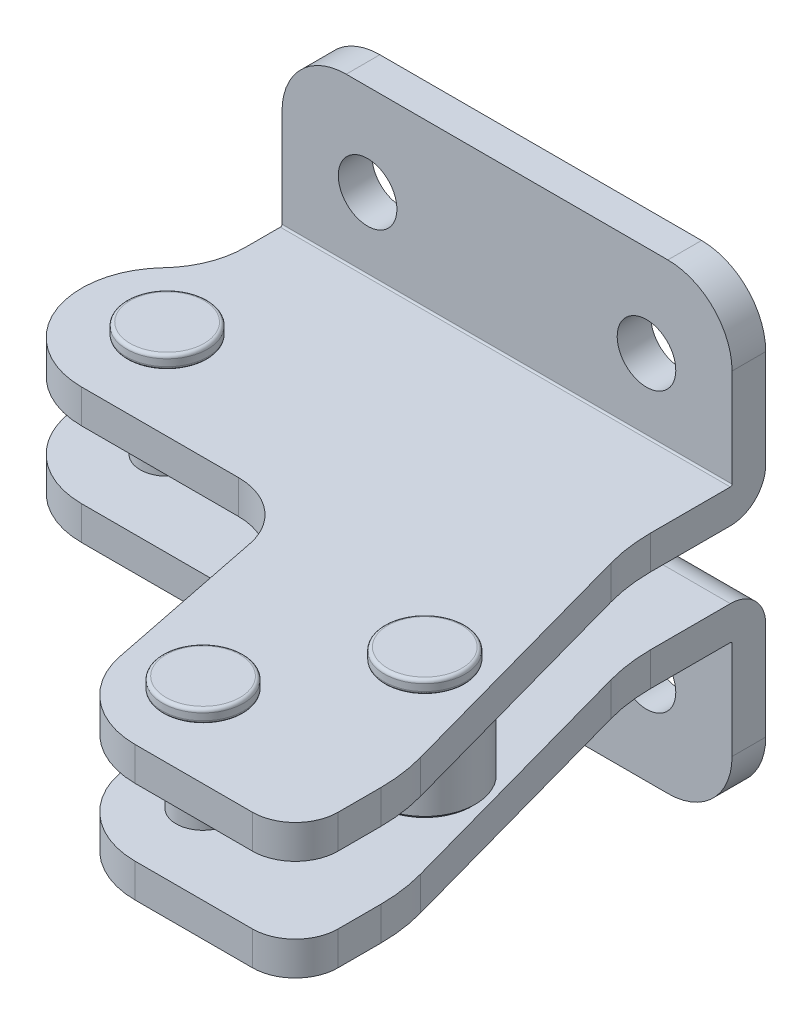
ISO-10303-21;
HEADER;
FILE_DESCRIPTION(('STEP AP214'),'2;1');
FILE_NAME('part.step','',(''),(''),'','','');
FILE_SCHEMA(('AUTOMOTIVE_DESIGN { 1 0 10303 214 1 1 1 1 }'));
ENDSEC;
DATA;
#1=APPLICATION_CONTEXT('core data for automotive mechanical design processes');
#2=APPLICATION_PROTOCOL_DEFINITION('international standard','automotive_design',2000,#1);
#3=PRODUCT_CONTEXT('',#1,'mechanical');
#4=PRODUCT('Part','Part','',(#3));
#5=PRODUCT_RELATED_PRODUCT_CATEGORY('part','',(#4));
#6=PRODUCT_DEFINITION_FORMATION('','',#4);
#7=PRODUCT_DEFINITION_CONTEXT('part definition',#1,'design');
#8=PRODUCT_DEFINITION('design','',#6,#7);
#9=PRODUCT_DEFINITION_SHAPE('','',#8);
#10=(LENGTH_UNIT() NAMED_UNIT(*) SI_UNIT(.MILLI.,.METRE.));
#11=(NAMED_UNIT(*) PLANE_ANGLE_UNIT() SI_UNIT($,.RADIAN.));
#12=(NAMED_UNIT(*) SI_UNIT($,.STERADIAN.) SOLID_ANGLE_UNIT());
#13=UNCERTAINTY_MEASURE_WITH_UNIT(LENGTH_MEASURE(1.E-05),#10,'distance_accuracy_value','');
#14=(GEOMETRIC_REPRESENTATION_CONTEXT(3) GLOBAL_UNCERTAINTY_ASSIGNED_CONTEXT((#13)) GLOBAL_UNIT_ASSIGNED_CONTEXT((#10,
#11,#12)) REPRESENTATION_CONTEXT('',''));
#15=CARTESIAN_POINT('',(0.,0.,0.));
#16=DIRECTION('',(0.,0.,1.));
#17=DIRECTION('',(1.,0.,0.));
#18=AXIS2_PLACEMENT_3D('',#15,#16,#17);
#19=CARTESIAN_POINT('',(41.399999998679,15.700155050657,69.8348443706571));
#20=DIRECTION('',(0.,-1.,0.));
#21=DIRECTION('',(0.,0.,1.));
#22=AXIS2_PLACEMENT_3D('',#19,#20,#21);
#23=PLANE('',#22);
#24=DIRECTION('',(1.,0.,0.));
#25=VECTOR('',#24,1.);
#26=CARTESIAN_POINT('',(41.399999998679,15.700155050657,5.25));
#27=LINE('',#26,#25);
#28=CARTESIAN_POINT('',(-12.6999999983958,15.700155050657,5.25));
#29=VERTEX_POINT('',#28);
#30=CARTESIAN_POINT('',(54.1000000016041,15.700155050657,5.25));
#31=VERTEX_POINT('',#30);
#32=EDGE_CURVE('E742',#29,#31,#27,.T.);
#33=ORIENTED_EDGE('',*,*,#32,.F.);
#34=DIRECTION('',(0.,0.,-1.));
#35=VECTOR('',#34,1.);
#36=CARTESIAN_POINT('',(-12.6999999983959,15.700155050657,10.4349853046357));
#37=LINE('',#36,#35);
#38=CARTESIAN_POINT('',(-12.6999999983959,15.700155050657,10.4349853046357));
#39=VERTEX_POINT('',#38);
#40=EDGE_CURVE('E814',#39,#29,#37,.T.);
#41=ORIENTED_EDGE('',*,*,#40,.F.);
#42=CARTESIAN_POINT('',(-25.3999999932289,15.700155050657,10.4349853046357));
#43=DIRECTION('',(0.,1.,0.));
#44=DIRECTION('',(0.,0.,-1.));
#45=AXIS2_PLACEMENT_3D('',#42,#43,#44);
#46=CIRCLE('',#45,12.6999999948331);
#47=CARTESIAN_POINT('',(-16.1543999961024,15.700155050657,19.1418148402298));
#48=VERTEX_POINT('',#47);
#49=EDGE_CURVE('E695',#48,#39,#46,.T.);
#50=ORIENTED_EDGE('',*,*,#49,.F.);
#51=CARTESIAN_POINT('',(-6.90879999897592,15.700155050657,27.848644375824));
#52=DIRECTION('',(0.,-1.,0.));
#53=DIRECTION('',(0.,0.,1.));
#54=AXIS2_PLACEMENT_3D('',#51,#52,#53);
#55=CIRCLE('',#54,12.6999999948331);
#56=CARTESIAN_POINT('',(-6.90879999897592,15.700155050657,40.548644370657));
#57=VERTEX_POINT('',#56);
#58=EDGE_CURVE('E673',#57,#48,#55,.T.);
#59=ORIENTED_EDGE('',*,*,#58,.F.);
#60=DIRECTION('',(-1.,0.,0.));
#61=VECTOR('',#60,1.);
#62=CARTESIAN_POINT('',(16.3871838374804,15.700155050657,40.548644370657));
#63=LINE('',#62,#61);
#64=CARTESIAN_POINT('',(16.3871838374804,15.700155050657,40.548644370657));
#65=VERTEX_POINT('',#64);
#66=EDGE_CURVE('E687',#65,#57,#63,.T.);
#67=ORIENTED_EDGE('',*,*,#66,.F.);
#68=CARTESIAN_POINT('',(16.3871838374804,15.700155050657,50.0736443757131));
#69=DIRECTION('',(0.,1.,0.));
#70=DIRECTION('',(0.,0.,-1.));
#71=AXIS2_PLACEMENT_3D('',#68,#69,#70);
#72=CIRCLE('',#71,9.52500000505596);
#73=CARTESIAN_POINT('',(25.7252713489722,15.700155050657,48.195947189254));
#74=VERTEX_POINT('',#73);
#75=EDGE_CURVE('E686',#74,#65,#72,.T.);
#76=ORIENTED_EDGE('',*,*,#75,.F.);
#77=DIRECTION('',(-0.197133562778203,0.,-0.980376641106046));
#78=VECTOR('',#77,1.);
#79=CARTESIAN_POINT('',(30.5798298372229,15.700155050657,72.3384406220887));
#80=LINE('',#79,#78);
#81=CARTESIAN_POINT('',(30.5798298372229,15.700155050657,72.3384406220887));
#82=VERTEX_POINT('',#81);
#83=EDGE_CURVE('E747',#82,#74,#80,.T.);
#84=ORIENTED_EDGE('',*,*,#83,.F.);
#85=CARTESIAN_POINT('',(43.0306131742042,15.700155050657,69.834844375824));
#86=DIRECTION('',(0.,-1.,0.));
#87=DIRECTION('',(0.,0.,1.));
#88=AXIS2_PLACEMENT_3D('',#85,#86,#87);
#89=CIRCLE('',#88,12.6999999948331);
#90=CARTESIAN_POINT('',(43.0306131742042,15.700155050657,82.5348443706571));
#91=VERTEX_POINT('',#90);
#92=EDGE_CURVE('E806',#91,#82,#89,.T.);
#93=ORIENTED_EDGE('',*,*,#92,.F.);
#94=DIRECTION('',(-1.,0.,0.));
#95=VECTOR('',#94,1.);
#96=CARTESIAN_POINT('',(60.4500000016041,15.700155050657,82.5348443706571));
#97=LINE('',#96,#95);
#98=CARTESIAN_POINT('',(60.4500000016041,15.700155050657,82.5348443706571));
#99=VERTEX_POINT('',#98);
#100=EDGE_CURVE('E652',#99,#91,#97,.T.);
#101=ORIENTED_EDGE('',*,*,#100,.F.);
#102=CARTESIAN_POINT('',(60.4500000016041,15.700155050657,76.1848443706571));
#103=DIRECTION('',(0.,-1.,0.));
#104=DIRECTION('',(0.,0.,1.));
#105=AXIS2_PLACEMENT_3D('',#102,#103,#104);
#106=CIRCLE('',#105,6.35);
#107=CARTESIAN_POINT('',(66.8000000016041,15.700155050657,76.1848443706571));
#108=VERTEX_POINT('',#107);
#109=EDGE_CURVE('E821',#108,#99,#106,.T.);
#110=ORIENTED_EDGE('',*,*,#109,.F.);
#111=DIRECTION('',(0.,0.,1.));
#112=VECTOR('',#111,1.);
#113=CARTESIAN_POINT('',(66.8000000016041,15.700155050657,69.8348443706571));
#114=LINE('',#113,#112);
#115=CARTESIAN_POINT('',(66.8000000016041,15.700155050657,69.8348443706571));
#116=VERTEX_POINT('',#115);
#117=EDGE_CURVE('E668',#116,#108,#114,.T.);
#118=ORIENTED_EDGE('',*,*,#117,.F.);
#119=CARTESIAN_POINT('',(41.399999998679,15.700155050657,69.8348443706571));
#120=DIRECTION('',(0.,-1.,0.));
#121=DIRECTION('',(0.,0.,1.));
#122=AXIS2_PLACEMENT_3D('',#119,#120,#121);
#123=CIRCLE('',#122,25.4000000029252);
#124=CARTESIAN_POINT('',(65.877508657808,15.700155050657,63.0516614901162));
#125=VERTEX_POINT('',#124);
#126=EDGE_CURVE('E244',#125,#116,#123,.T.);
#127=ORIENTED_EDGE('',*,*,#126,.F.);
#128=DIRECTION('',(0.267054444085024,0.,0.963681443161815));
#129=VECTOR('',#128,1.);
#130=CARTESIAN_POINT('',(55.0224913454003,15.700155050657,23.8807022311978));
#131=LINE('',#130,#129);
#132=CARTESIAN_POINT('',(55.0224913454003,15.700155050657,23.8807022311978));
#133=VERTEX_POINT('',#132);
#134=EDGE_CURVE('E235',#133,#125,#131,.T.);
#135=ORIENTED_EDGE('',*,*,#134,.F.);
#136=CARTESIAN_POINT('',(79.5000000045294,15.700155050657,17.0975193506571));
#137=DIRECTION('',(0.,1.,0.));
#138=DIRECTION('',(0.,0.,-1.));
#139=AXIS2_PLACEMENT_3D('',#136,#137,#138);
#140=CIRCLE('',#139,25.4000000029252);
#141=CARTESIAN_POINT('',(54.1000000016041,15.700155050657,17.0975193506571));
#142=VERTEX_POINT('',#141);
#143=EDGE_CURVE('E241',#142,#133,#140,.T.);
#144=ORIENTED_EDGE('',*,*,#143,.F.);
#145=DIRECTION('',(0.,0.,1.));
#146=VECTOR('',#145,1.);
#147=CARTESIAN_POINT('',(54.1000000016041,15.700155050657,-13.594844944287));
#148=LINE('',#147,#146);
#149=EDGE_CURVE('E766',#31,#142,#148,.T.);
#150=ORIENTED_EDGE('',*,*,#149,.F.);
#151=EDGE_LOOP('',(#33,#41,#50,#59,#67,#76,#84,#93,#101,#110,#118,#127,#135,#144,#150));
#152=FACE_BOUND('',#151,.T.);
#153=CARTESIAN_POINT('',(-6.90879999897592,15.700155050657,27.848644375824));
#154=DIRECTION('',(0.,-1.,0.));
#155=DIRECTION('',(1.,0.,0.));
#156=AXIS2_PLACEMENT_3D('',#153,#154,#155);
#157=CIRCLE('',#156,4.);
#158=CARTESIAN_POINT('',(-2.90879999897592,15.700155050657,27.848644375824));
#159=VERTEX_POINT('',#158);
#160=EDGE_CURVE('E275',#159,#159,#157,.F.);
#161=ORIENTED_EDGE('',*,*,#160,.F.);
#162=EDGE_LOOP('',(#161));
#163=FACE_BOUND('',#162,.T.);
#164=CARTESIAN_POINT('',(41.2750000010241,15.700155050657,70.699844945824));
#165=DIRECTION('',(0.,-1.,0.));
#166=DIRECTION('',(1.,0.,0.));
#167=AXIS2_PLACEMENT_3D('',#164,#165,#166);
#168=CIRCLE('',#167,4.);
#169=CARTESIAN_POINT('',(45.2750000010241,15.700155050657,70.699844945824));
#170=VERTEX_POINT('',#169);
#171=EDGE_CURVE('E19',#170,#170,#168,.F.);
#172=ORIENTED_EDGE('',*,*,#171,.F.);
#173=EDGE_LOOP('',(#172));
#174=FACE_BOUND('',#173,.T.);
#175=CARTESIAN_POINT('',(53.9750000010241,15.700155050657,50.484844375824));
#176=DIRECTION('',(0.,-1.,0.));
#177=DIRECTION('',(-1.,0.,0.));
#178=AXIS2_PLACEMENT_3D('',#175,#176,#177);
#179=CIRCLE('',#178,7.);
#180=CARTESIAN_POINT('',(46.9750000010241,15.700155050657,50.484844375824));
#181=VERTEX_POINT('',#180);
#182=EDGE_CURVE('E2733',#181,#181,#179,.T.);
#183=ORIENTED_EDGE('',*,*,#182,.T.);
#184=EDGE_LOOP('',(#183));
#185=FACE_BOUND('',#184,.T.);
#186=ADVANCED_FACE('F15',(#152,#163,#174,#185),#23,.F.);
#187=CARTESIAN_POINT('',(87.8259988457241,10.450155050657,5.25));
#188=DIRECTION('',(-1.,0.,0.));
#189=DIRECTION('',(0.,0.,1.));
#190=AXIS2_PLACEMENT_3D('',#187,#188,#189);
#191=CYLINDRICAL_SURFACE('',#190,5.25);
#192=CARTESIAN_POINT('',(54.1000000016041,10.450155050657,5.25));
#193=DIRECTION('',(-1.,0.,0.));
#194=DIRECTION('',(0.,0.,-1.));
#195=AXIS2_PLACEMENT_3D('',#192,#193,#194);
#196=CIRCLE('',#195,5.25);
#197=CARTESIAN_POINT('',(54.1000000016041,10.450155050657,0.));
#198=VERTEX_POINT('',#197);
#199=EDGE_CURVE('E529',#31,#198,#196,.T.);
#200=ORIENTED_EDGE('',*,*,#199,.T.);
#201=DIRECTION('',(1.,0.,0.));
#202=VECTOR('',#201,1.);
#203=CARTESIAN_POINT('',(41.399999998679,10.450155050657,0.));
#204=LINE('',#203,#202);
#205=CARTESIAN_POINT('',(-12.6999999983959,10.450155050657,0.));
#206=VERTEX_POINT('',#205);
#207=EDGE_CURVE('E273',#206,#198,#204,.T.);
#208=ORIENTED_EDGE('',*,*,#207,.F.);
#209=CARTESIAN_POINT('',(-12.6999999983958,10.450155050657,5.25));
#210=DIRECTION('',(1.,0.,0.));
#211=DIRECTION('',(0.,0.,1.));
#212=AXIS2_PLACEMENT_3D('',#209,#210,#211);
#213=CIRCLE('',#212,5.25);
#214=EDGE_CURVE('E678',#206,#29,#213,.T.);
#215=ORIENTED_EDGE('',*,*,#214,.T.);
#216=ORIENTED_EDGE('',*,*,#32,.T.);
#217=EDGE_LOOP('',(#200,#208,#215,#216));
#218=FACE_BOUND('',#217,.T.);
#219=ADVANCED_FACE('F905',(#218),#191,.T.);
#220=CARTESIAN_POINT('',(-25.3999999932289,15.700155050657,10.4349853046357));
#221=DIRECTION('',(0.,-1.,0.));
#222=DIRECTION('',(0.,0.,1.));
#223=AXIS2_PLACEMENT_3D('',#220,#221,#222);
#224=CYLINDRICAL_SURFACE('',#223,12.6999999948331);
#225=CARTESIAN_POINT('',(-25.3999999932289,10.700155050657,10.4349853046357));
#226=DIRECTION('',(0.,1.,0.));
#227=DIRECTION('',(0.,0.,-1.));
#228=AXIS2_PLACEMENT_3D('',#225,#226,#227);
#229=CIRCLE('',#228,12.6999999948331);
#230=CARTESIAN_POINT('',(-16.1543999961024,10.700155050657,19.1418148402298));
#231=VERTEX_POINT('',#230);
#232=CARTESIAN_POINT('',(-12.6999999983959,10.700155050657,10.4349853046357));
#233=VERTEX_POINT('',#232);
#234=EDGE_CURVE('E691',#231,#233,#229,.T.);
#235=ORIENTED_EDGE('',*,*,#234,.F.);
#236=DIRECTION('',(0.,-1.,0.));
#237=VECTOR('',#236,1.);
#238=CARTESIAN_POINT('',(-16.1543999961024,15.700155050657,19.1418148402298));
#239=LINE('',#238,#237);
#240=EDGE_CURVE('E696',#48,#231,#239,.T.);
#241=ORIENTED_EDGE('',*,*,#240,.F.);
#242=ORIENTED_EDGE('',*,*,#49,.T.);
#243=DIRECTION('',(0.,-1.,0.));
#244=VECTOR('',#243,1.);
#245=CARTESIAN_POINT('',(-12.6999999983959,15.700155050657,10.4349853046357));
#246=LINE('',#245,#244);
#247=EDGE_CURVE('E738',#39,#233,#246,.T.);
#248=ORIENTED_EDGE('',*,*,#247,.T.);
#249=EDGE_LOOP('',(#235,#241,#242,#248));
#250=FACE_BOUND('',#249,.T.);
#251=ADVANCED_FACE('F1737',(#250),#224,.F.);
#252=CARTESIAN_POINT('',(-6.90879999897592,15.700155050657,27.848644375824));
#253=DIRECTION('',(0.,-1.,0.));
#254=DIRECTION('',(0.,0.,1.));
#255=AXIS2_PLACEMENT_3D('',#252,#253,#254);
#256=CYLINDRICAL_SURFACE('',#255,12.6999999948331);
#257=CARTESIAN_POINT('',(-6.90879999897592,10.700155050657,27.848644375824));
#258=DIRECTION('',(0.,-1.,0.));
#259=DIRECTION('',(0.,0.,1.));
#260=AXIS2_PLACEMENT_3D('',#257,#258,#259);
#261=CIRCLE('',#260,12.6999999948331);
#262=CARTESIAN_POINT('',(-6.90879999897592,10.700155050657,40.548644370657));
#263=VERTEX_POINT('',#262);
#264=EDGE_CURVE('E669',#263,#231,#261,.T.);
#265=ORIENTED_EDGE('',*,*,#264,.F.);
#266=DIRECTION('',(0.,-1.,0.));
#267=VECTOR('',#266,1.);
#268=CARTESIAN_POINT('',(-6.90879999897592,15.700155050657,40.548644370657));
#269=LINE('',#268,#267);
#270=EDGE_CURVE('E674',#57,#263,#269,.T.);
#271=ORIENTED_EDGE('',*,*,#270,.F.);
#272=ORIENTED_EDGE('',*,*,#58,.T.);
#273=ORIENTED_EDGE('',*,*,#240,.T.);
#274=EDGE_LOOP('',(#265,#271,#272,#273));
#275=FACE_BOUND('',#274,.T.);
#276=ADVANCED_FACE('F1746',(#275),#256,.T.);
#277=CARTESIAN_POINT('',(16.3871838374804,15.700155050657,40.548644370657));
#278=DIRECTION('',(0.,0.,1.));
#279=DIRECTION('',(1.,0.,0.));
#280=AXIS2_PLACEMENT_3D('',#277,#278,#279);
#281=PLANE('',#280);
#282=DIRECTION('',(-1.,0.,0.));
#283=VECTOR('',#282,1.);
#284=CARTESIAN_POINT('',(16.3871838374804,10.700155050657,40.548644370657));
#285=LINE('',#284,#283);
#286=CARTESIAN_POINT('',(16.3871838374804,10.700155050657,40.548644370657));
#287=VERTEX_POINT('',#286);
#288=EDGE_CURVE('E685',#287,#263,#285,.T.);
#289=ORIENTED_EDGE('',*,*,#288,.F.);
#290=DIRECTION('',(0.,-1.,0.));
#291=VECTOR('',#290,1.);
#292=CARTESIAN_POINT('',(16.3871838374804,15.700155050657,40.548644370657));
#293=LINE('',#292,#291);
#294=EDGE_CURVE('E681',#65,#287,#293,.T.);
#295=ORIENTED_EDGE('',*,*,#294,.F.);
#296=ORIENTED_EDGE('',*,*,#66,.T.);
#297=ORIENTED_EDGE('',*,*,#270,.T.);
#298=EDGE_LOOP('',(#289,#295,#296,#297));
#299=FACE_BOUND('',#298,.T.);
#300=ADVANCED_FACE('F1757',(#299),#281,.T.);
#301=CARTESIAN_POINT('',(16.3871838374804,15.700155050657,50.0736443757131));
#302=DIRECTION('',(0.,-1.,0.));
#303=DIRECTION('',(0.,0.,1.));
#304=AXIS2_PLACEMENT_3D('',#301,#302,#303);
#305=CYLINDRICAL_SURFACE('',#304,9.52500000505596);
#306=CARTESIAN_POINT('',(16.3871838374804,10.700155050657,50.0736443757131));
#307=DIRECTION('',(0.,1.,0.));
#308=DIRECTION('',(0.,0.,-1.));
#309=AXIS2_PLACEMENT_3D('',#306,#307,#308);
#310=CIRCLE('',#309,9.52500000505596);
#311=CARTESIAN_POINT('',(25.7252713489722,10.700155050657,48.195947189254));
#312=VERTEX_POINT('',#311);
#313=EDGE_CURVE('E753',#312,#287,#310,.T.);
#314=ORIENTED_EDGE('',*,*,#313,.F.);
#315=DIRECTION('',(0.,-1.,0.));
#316=VECTOR('',#315,1.);
#317=CARTESIAN_POINT('',(25.7252713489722,15.700155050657,48.195947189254));
#318=LINE('',#317,#316);
#319=EDGE_CURVE('E749',#74,#312,#318,.T.);
#320=ORIENTED_EDGE('',*,*,#319,.F.);
#321=ORIENTED_EDGE('',*,*,#75,.T.);
#322=ORIENTED_EDGE('',*,*,#294,.T.);
#323=EDGE_LOOP('',(#314,#320,#321,#322));
#324=FACE_BOUND('',#323,.T.);
#325=ADVANCED_FACE('F1768',(#324),#305,.F.);
#326=CARTESIAN_POINT('',(30.5798298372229,15.700155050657,72.3384406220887));
#327=DIRECTION('',(-0.980376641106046,0.,0.197133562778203));
#328=DIRECTION('',(0.,1.,0.));
#329=AXIS2_PLACEMENT_3D('',#326,#327,#328);
#330=PLANE('',#329);
#331=DIRECTION('',(-0.197133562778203,0.,-0.980376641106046));
#332=VECTOR('',#331,1.);
#333=CARTESIAN_POINT('',(30.5798298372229,10.700155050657,72.3384406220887));
#334=LINE('',#333,#332);
#335=CARTESIAN_POINT('',(30.5798298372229,10.700155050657,72.3384406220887));
#336=VERTEX_POINT('',#335);
#337=EDGE_CURVE('E743',#336,#312,#334,.T.);
#338=ORIENTED_EDGE('',*,*,#337,.F.);
#339=DIRECTION('',(0.,-1.,0.));
#340=VECTOR('',#339,1.);
#341=CARTESIAN_POINT('',(30.5798298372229,15.700155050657,72.3384406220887));
#342=LINE('',#341,#340);
#343=EDGE_CURVE('E748',#82,#336,#342,.T.);
#344=ORIENTED_EDGE('',*,*,#343,.F.);
#345=ORIENTED_EDGE('',*,*,#83,.T.);
#346=ORIENTED_EDGE('',*,*,#319,.T.);
#347=EDGE_LOOP('',(#338,#344,#345,#346));
#348=FACE_BOUND('',#347,.T.);
#349=ADVANCED_FACE('F1779',(#348),#330,.T.);
#350=CARTESIAN_POINT('',(43.0306131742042,15.700155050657,69.834844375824));
#351=DIRECTION('',(0.,-1.,0.));
#352=DIRECTION('',(0.,0.,1.));
#353=AXIS2_PLACEMENT_3D('',#350,#351,#352);
#354=CYLINDRICAL_SURFACE('',#353,12.6999999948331);
#355=CARTESIAN_POINT('',(43.0306131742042,10.700155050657,69.834844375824));
#356=DIRECTION('',(0.,-1.,0.));
#357=DIRECTION('',(0.,0.,1.));
#358=AXIS2_PLACEMENT_3D('',#355,#356,#357);
#359=CIRCLE('',#358,12.6999999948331);
#360=CARTESIAN_POINT('',(43.0306131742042,10.700155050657,82.5348443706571));
#361=VERTEX_POINT('',#360);
#362=EDGE_CURVE('E810',#361,#336,#359,.T.);
#363=ORIENTED_EDGE('',*,*,#362,.F.);
#364=DIRECTION('',(0.,-1.,0.));
#365=VECTOR('',#364,1.);
#366=CARTESIAN_POINT('',(43.0306131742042,15.700155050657,82.5348443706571));
#367=LINE('',#366,#365);
#368=EDGE_CURVE('E656',#91,#361,#367,.T.);
#369=ORIENTED_EDGE('',*,*,#368,.F.);
#370=ORIENTED_EDGE('',*,*,#92,.T.);
#371=ORIENTED_EDGE('',*,*,#343,.T.);
#372=EDGE_LOOP('',(#363,#369,#370,#371));
#373=FACE_BOUND('',#372,.T.);
#374=ADVANCED_FACE('F1790',(#373),#354,.T.);
#375=CARTESIAN_POINT('',(60.4500000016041,15.700155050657,82.5348443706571));
#376=DIRECTION('',(0.,0.,1.));
#377=DIRECTION('',(0.,1.,0.));
#378=AXIS2_PLACEMENT_3D('',#375,#376,#377);
#379=PLANE('',#378);
#380=DIRECTION('',(-1.,0.,0.));
#381=VECTOR('',#380,1.);
#382=CARTESIAN_POINT('',(60.4500000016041,10.700155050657,82.5348443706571));
#383=LINE('',#382,#381);
#384=CARTESIAN_POINT('',(60.4500000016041,10.700155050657,82.5348443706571));
#385=VERTEX_POINT('',#384);
#386=EDGE_CURVE('E657',#385,#361,#383,.T.);
#387=ORIENTED_EDGE('',*,*,#386,.F.);
#388=DIRECTION('',(0.,-1.,0.));
#389=VECTOR('',#388,1.);
#390=CARTESIAN_POINT('',(60.4500000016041,15.700155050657,82.5348443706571));
#391=LINE('',#390,#389);
#392=EDGE_CURVE('E825',#99,#385,#391,.T.);
#393=ORIENTED_EDGE('',*,*,#392,.F.);
#394=ORIENTED_EDGE('',*,*,#100,.T.);
#395=ORIENTED_EDGE('',*,*,#368,.T.);
#396=EDGE_LOOP('',(#387,#393,#394,#395));
#397=FACE_BOUND('',#396,.T.);
#398=ADVANCED_FACE('F1801',(#397),#379,.T.);
#399=CARTESIAN_POINT('',(60.4500000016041,15.700155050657,76.1848443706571));
#400=DIRECTION('',(0.,-1.,0.));
#401=DIRECTION('',(0.,0.,1.));
#402=AXIS2_PLACEMENT_3D('',#399,#400,#401);
#403=CYLINDRICAL_SURFACE('',#402,6.35);
#404=CARTESIAN_POINT('',(60.4500000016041,10.700155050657,76.1848443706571));
#405=DIRECTION('',(0.,-1.,0.));
#406=DIRECTION('',(0.,0.,1.));
#407=AXIS2_PLACEMENT_3D('',#404,#405,#406);
#408=CIRCLE('',#407,6.35);
#409=CARTESIAN_POINT('',(66.8000000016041,10.700155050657,76.1848443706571));
#410=VERTEX_POINT('',#409);
#411=EDGE_CURVE('E667',#410,#385,#408,.T.);
#412=ORIENTED_EDGE('',*,*,#411,.F.);
#413=DIRECTION('',(0.,-1.,0.));
#414=VECTOR('',#413,1.);
#415=CARTESIAN_POINT('',(66.8000000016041,15.700155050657,76.1848443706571));
#416=LINE('',#415,#414);
#417=EDGE_CURVE('E663',#108,#410,#416,.T.);
#418=ORIENTED_EDGE('',*,*,#417,.F.);
#419=ORIENTED_EDGE('',*,*,#109,.T.);
#420=ORIENTED_EDGE('',*,*,#392,.T.);
#421=EDGE_LOOP('',(#412,#418,#419,#420));
#422=FACE_BOUND('',#421,.T.);
#423=ADVANCED_FACE('F17',(#422),#403,.T.);
#424=CARTESIAN_POINT('',(66.8000000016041,15.700155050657,69.8348443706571));
#425=DIRECTION('',(1.,0.,0.));
#426=DIRECTION('',(0.,0.,-1.));
#427=AXIS2_PLACEMENT_3D('',#424,#425,#426);
#428=PLANE('',#427);
#429=DIRECTION('',(0.,0.,1.));
#430=VECTOR('',#429,1.);
#431=CARTESIAN_POINT('',(66.8000000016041,10.700155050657,69.8348443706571));
#432=LINE('',#431,#430);
#433=CARTESIAN_POINT('',(66.8000000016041,10.700155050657,69.8348443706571));
#434=VERTEX_POINT('',#433);
#435=EDGE_CURVE('E730',#434,#410,#432,.T.);
#436=ORIENTED_EDGE('',*,*,#435,.F.);
#437=DIRECTION('',(0.,-1.,0.));
#438=VECTOR('',#437,1.);
#439=CARTESIAN_POINT('',(66.8000000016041,15.700155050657,69.8348443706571));
#440=LINE('',#439,#438);
#441=EDGE_CURVE('E734',#116,#434,#440,.T.);
#442=ORIENTED_EDGE('',*,*,#441,.F.);
#443=ORIENTED_EDGE('',*,*,#117,.T.);
#444=ORIENTED_EDGE('',*,*,#417,.T.);
#445=EDGE_LOOP('',(#436,#442,#443,#444));
#446=FACE_BOUND('',#445,.T.);
#447=ADVANCED_FACE('F1822',(#446),#428,.T.);
#448=CARTESIAN_POINT('',(41.399999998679,15.700155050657,69.8348443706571));
#449=DIRECTION('',(0.,-1.,0.));
#450=DIRECTION('',(0.,0.,1.));
#451=AXIS2_PLACEMENT_3D('',#448,#449,#450);
#452=CYLINDRICAL_SURFACE('',#451,25.4000000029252);
#453=CARTESIAN_POINT('',(41.399999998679,10.700155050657,69.8348443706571));
#454=DIRECTION('',(0.,-1.,0.));
#455=DIRECTION('',(0.,0.,1.));
#456=AXIS2_PLACEMENT_3D('',#453,#454,#455);
#457=CIRCLE('',#456,25.4000000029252);
#458=CARTESIAN_POINT('',(65.877508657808,10.700155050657,63.0516614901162));
#459=VERTEX_POINT('',#458);
#460=EDGE_CURVE('E648',#459,#434,#457,.T.);
#461=ORIENTED_EDGE('',*,*,#460,.F.);
#462=DIRECTION('',(0.,-1.,0.));
#463=VECTOR('',#462,1.);
#464=CARTESIAN_POINT('',(65.877508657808,15.700155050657,63.0516614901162));
#465=LINE('',#464,#463);
#466=EDGE_CURVE('E249',#125,#459,#465,.T.);
#467=ORIENTED_EDGE('',*,*,#466,.F.);
#468=ORIENTED_EDGE('',*,*,#126,.T.);
#469=ORIENTED_EDGE('',*,*,#441,.T.);
#470=EDGE_LOOP('',(#461,#467,#468,#469));
#471=FACE_BOUND('',#470,.T.);
#472=ADVANCED_FACE('F1832',(#471),#452,.T.);
#473=CARTESIAN_POINT('',(55.0224913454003,15.700155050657,23.8807022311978));
#474=DIRECTION('',(0.963681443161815,0.,-0.267054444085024));
#475=DIRECTION('',(-0.267054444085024,0.,-0.963681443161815));
#476=AXIS2_PLACEMENT_3D('',#473,#474,#475);
#477=PLANE('',#476);
#478=DIRECTION('',(0.267054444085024,0.,0.963681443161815));
#479=VECTOR('',#478,1.);
#480=CARTESIAN_POINT('',(55.0224913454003,10.700155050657,23.8807022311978));
#481=LINE('',#480,#479);
#482=CARTESIAN_POINT('',(55.0224913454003,10.700155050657,23.8807022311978));
#483=VERTEX_POINT('',#482);
#484=EDGE_CURVE('E250',#483,#459,#481,.T.);
#485=ORIENTED_EDGE('',*,*,#484,.F.);
#486=DIRECTION('',(0.,-1.,0.));
#487=VECTOR('',#486,1.);
#488=CARTESIAN_POINT('',(55.0224913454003,15.700155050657,23.8807022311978));
#489=LINE('',#488,#487);
#490=EDGE_CURVE('E253',#133,#483,#489,.T.);
#491=ORIENTED_EDGE('',*,*,#490,.F.);
#492=ORIENTED_EDGE('',*,*,#134,.T.);
#493=ORIENTED_EDGE('',*,*,#466,.T.);
#494=EDGE_LOOP('',(#485,#491,#492,#493));
#495=FACE_BOUND('',#494,.T.);
#496=ADVANCED_FACE('F254',(#495),#477,.T.);
#497=CARTESIAN_POINT('',(79.5000000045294,15.700155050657,17.0975193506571));
#498=DIRECTION('',(0.,-1.,0.));
#499=DIRECTION('',(0.,0.,1.));
#500=AXIS2_PLACEMENT_3D('',#497,#498,#499);
#501=CYLINDRICAL_SURFACE('',#500,25.4000000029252);
#502=CARTESIAN_POINT('',(79.5000000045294,10.700155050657,17.0975193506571));
#503=DIRECTION('',(0.,1.,0.));
#504=DIRECTION('',(0.,0.,-1.));
#505=AXIS2_PLACEMENT_3D('',#502,#503,#504);
#506=CIRCLE('',#505,25.4000000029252);
#507=CARTESIAN_POINT('',(54.1000000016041,10.700155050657,17.0975193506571));
#508=VERTEX_POINT('',#507);
#509=EDGE_CURVE('E269',#508,#483,#506,.T.);
#510=ORIENTED_EDGE('',*,*,#509,.F.);
#511=DIRECTION('',(0.,-1.,0.));
#512=VECTOR('',#511,1.);
#513=CARTESIAN_POINT('',(54.1000000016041,15.700155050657,17.0975193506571));
#514=LINE('',#513,#512);
#515=EDGE_CURVE('E263',#142,#508,#514,.T.);
#516=ORIENTED_EDGE('',*,*,#515,.F.);
#517=ORIENTED_EDGE('',*,*,#143,.T.);
#518=ORIENTED_EDGE('',*,*,#490,.T.);
#519=EDGE_LOOP('',(#510,#516,#517,#518));
#520=FACE_BOUND('',#519,.T.);
#521=ADVANCED_FACE('F261',(#520),#501,.F.);
#522=CARTESIAN_POINT('',(41.3999999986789,25.700155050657,69.8348443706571));
#523=DIRECTION('',(0.,-1.,0.));
#524=DIRECTION('',(0.,0.,1.));
#525=AXIS2_PLACEMENT_3D('',#522,#523,#524);
#526=PLANE('',#525);
#527=CARTESIAN_POINT('',(53.9750000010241,25.700155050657,50.484844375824));
#528=DIRECTION('',(0.,1.,0.));
#529=DIRECTION('',(-1.,0.,0.));
#530=AXIS2_PLACEMENT_3D('',#527,#528,#529);
#531=CIRCLE('',#530,7.);
#532=CARTESIAN_POINT('',(46.9750000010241,25.700155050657,50.484844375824));
#533=VERTEX_POINT('',#532);
#534=EDGE_CURVE('E296',#533,#533,#531,.T.);
#535=ORIENTED_EDGE('',*,*,#534,.T.);
#536=EDGE_LOOP('',(#535));
#537=FACE_BOUND('',#536,.T.);
#538=CARTESIAN_POINT('',(41.2750000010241,25.700155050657,70.699844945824));
#539=DIRECTION('',(0.,-1.,0.));
#540=DIRECTION('',(1.,0.,0.));
#541=AXIS2_PLACEMENT_3D('',#538,#539,#540);
#542=CIRCLE('',#541,4.);
#543=CARTESIAN_POINT('',(45.2750000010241,25.700155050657,70.699844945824));
#544=VERTEX_POINT('',#543);
#545=EDGE_CURVE('E290',#544,#544,#542,.F.);
#546=ORIENTED_EDGE('',*,*,#545,.T.);
#547=EDGE_LOOP('',(#546));
#548=FACE_BOUND('',#547,.T.);
#549=CARTESIAN_POINT('',(-6.90879999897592,25.700155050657,27.848644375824));
#550=DIRECTION('',(0.,-1.,0.));
#551=DIRECTION('',(1.,0.,0.));
#552=AXIS2_PLACEMENT_3D('',#549,#550,#551);
#553=CIRCLE('',#552,4.);
#554=CARTESIAN_POINT('',(-2.90879999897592,25.700155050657,27.848644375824));
#555=VERTEX_POINT('',#554);
#556=EDGE_CURVE('E278',#555,#555,#553,.F.);
#557=ORIENTED_EDGE('',*,*,#556,.T.);
#558=EDGE_LOOP('',(#557));
#559=FACE_BOUND('',#558,.T.);
#560=DIRECTION('',(0.,0.,-1.));
#561=VECTOR('',#560,1.);
#562=CARTESIAN_POINT('',(-12.6999999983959,25.700155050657,10.4349853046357));
#563=LINE('',#562,#561);
#564=CARTESIAN_POINT('',(-12.6999999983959,25.700155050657,10.4349853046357));
#565=VERTEX_POINT('',#564);
#566=CARTESIAN_POINT('',(-12.6999999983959,25.700155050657,5.24984494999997));
#567=VERTEX_POINT('',#566);
#568=EDGE_CURVE('E455',#565,#567,#563,.T.);
#569=ORIENTED_EDGE('',*,*,#568,.T.);
#570=DIRECTION('',(1.,0.,0.));
#571=VECTOR('',#570,1.);
#572=CARTESIAN_POINT('',(41.3999999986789,25.700155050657,5.24984494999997));
#573=LINE('',#572,#571);
#574=CARTESIAN_POINT('',(54.1000000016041,25.700155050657,5.24984495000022));
#575=VERTEX_POINT('',#574);
#576=EDGE_CURVE('E450',#567,#575,#573,.T.);
#577=ORIENTED_EDGE('',*,*,#576,.T.);
#578=DIRECTION('',(0.,0.,1.));
#579=VECTOR('',#578,1.);
#580=CARTESIAN_POINT('',(54.1000000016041,25.700155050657,-13.594844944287));
#581=LINE('',#580,#579);
#582=CARTESIAN_POINT('',(54.1000000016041,25.700155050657,17.0975193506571));
#583=VERTEX_POINT('',#582);
#584=EDGE_CURVE('E454',#575,#583,#581,.T.);
#585=ORIENTED_EDGE('',*,*,#584,.T.);
#586=CARTESIAN_POINT('',(79.5000000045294,25.700155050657,17.0975193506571));
#587=DIRECTION('',(0.,1.,0.));
#588=DIRECTION('',(0.,0.,-1.));
#589=AXIS2_PLACEMENT_3D('',#586,#587,#588);
#590=CIRCLE('',#589,25.4000000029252);
#591=CARTESIAN_POINT('',(55.0224913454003,25.700155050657,23.8807022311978));
#592=VERTEX_POINT('',#591);
#593=EDGE_CURVE('E542',#583,#592,#590,.T.);
#594=ORIENTED_EDGE('',*,*,#593,.T.);
#595=DIRECTION('',(0.267054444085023,0.,0.963681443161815));
#596=VECTOR('',#595,1.);
#597=CARTESIAN_POINT('',(55.0224913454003,25.700155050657,23.8807022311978));
#598=LINE('',#597,#596);
#599=CARTESIAN_POINT('',(65.877508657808,25.700155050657,63.0516614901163));
#600=VERTEX_POINT('',#599);
#601=EDGE_CURVE('E475',#592,#600,#598,.T.);
#602=ORIENTED_EDGE('',*,*,#601,.T.);
#603=CARTESIAN_POINT('',(41.3999999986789,25.700155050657,69.8348443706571));
#604=DIRECTION('',(0.,-1.,0.));
#605=DIRECTION('',(0.,0.,1.));
#606=AXIS2_PLACEMENT_3D('',#603,#604,#605);
#607=CIRCLE('',#606,25.4000000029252);
#608=CARTESIAN_POINT('',(66.8000000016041,25.700155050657,69.8348443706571));
#609=VERTEX_POINT('',#608);
#610=EDGE_CURVE('E400',#600,#609,#607,.T.);
#611=ORIENTED_EDGE('',*,*,#610,.T.);
#612=DIRECTION('',(0.,0.,1.));
#613=VECTOR('',#612,1.);
#614=CARTESIAN_POINT('',(66.8000000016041,25.700155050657,69.8348443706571));
#615=LINE('',#614,#613);
#616=CARTESIAN_POINT('',(66.8000000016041,25.700155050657,76.1848443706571));
#617=VERTEX_POINT('',#616);
#618=EDGE_CURVE('E418',#609,#617,#615,.T.);
#619=ORIENTED_EDGE('',*,*,#618,.T.);
#620=CARTESIAN_POINT('',(60.4500000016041,25.700155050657,76.1848443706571));
#621=DIRECTION('',(0.,-1.,0.));
#622=DIRECTION('',(0.,0.,1.));
#623=AXIS2_PLACEMENT_3D('',#620,#621,#622);
#624=CIRCLE('',#623,6.35);
#625=CARTESIAN_POINT('',(60.4500000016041,25.700155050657,82.5348443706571));
#626=VERTEX_POINT('',#625);
#627=EDGE_CURVE('E512',#617,#626,#624,.T.);
#628=ORIENTED_EDGE('',*,*,#627,.T.);
#629=DIRECTION('',(-1.,0.,0.));
#630=VECTOR('',#629,1.);
#631=CARTESIAN_POINT('',(60.4500000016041,25.700155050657,82.5348443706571));
#632=LINE('',#631,#630);
#633=CARTESIAN_POINT('',(43.0306131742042,25.700155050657,82.5348443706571));
#634=VERTEX_POINT('',#633);
#635=EDGE_CURVE('E443',#626,#634,#632,.T.);
#636=ORIENTED_EDGE('',*,*,#635,.T.);
#637=CARTESIAN_POINT('',(43.0306131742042,25.700155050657,69.834844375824));
#638=DIRECTION('',(0.,-1.,0.));
#639=DIRECTION('',(0.,0.,1.));
#640=AXIS2_PLACEMENT_3D('',#637,#638,#639);
#641=CIRCLE('',#640,12.6999999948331);
#642=CARTESIAN_POINT('',(30.5798298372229,25.700155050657,72.3384406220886));
#643=VERTEX_POINT('',#642);
#644=EDGE_CURVE('E428',#634,#643,#641,.T.);
#645=ORIENTED_EDGE('',*,*,#644,.T.);
#646=DIRECTION('',(-0.197133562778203,0.,-0.980376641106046));
#647=VECTOR('',#646,1.);
#648=CARTESIAN_POINT('',(30.5798298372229,25.700155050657,72.3384406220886));
#649=LINE('',#648,#647);
#650=CARTESIAN_POINT('',(25.7252713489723,25.700155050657,48.195947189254));
#651=VERTEX_POINT('',#650);
#652=EDGE_CURVE('E533',#643,#651,#649,.T.);
#653=ORIENTED_EDGE('',*,*,#652,.T.);
#654=CARTESIAN_POINT('',(16.3871838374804,25.700155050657,50.0736443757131));
#655=DIRECTION('',(0.,1.,0.));
#656=DIRECTION('',(0.,0.,-1.));
#657=AXIS2_PLACEMENT_3D('',#654,#655,#656);
#658=CIRCLE('',#657,9.52500000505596);
#659=CARTESIAN_POINT('',(16.3871838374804,25.700155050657,40.548644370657));
#660=VERTEX_POINT('',#659);
#661=EDGE_CURVE('E434',#651,#660,#658,.T.);
#662=ORIENTED_EDGE('',*,*,#661,.T.);
#663=DIRECTION('',(-1.,0.,0.));
#664=VECTOR('',#663,1.);
#665=CARTESIAN_POINT('',(16.3871838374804,25.700155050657,40.548644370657));
#666=LINE('',#665,#664);
#667=CARTESIAN_POINT('',(-6.90879999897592,25.700155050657,40.548644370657));
#668=VERTEX_POINT('',#667);
#669=EDGE_CURVE('E395',#660,#668,#666,.T.);
#670=ORIENTED_EDGE('',*,*,#669,.T.);
#671=CARTESIAN_POINT('',(-6.90879999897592,25.700155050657,27.848644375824));
#672=DIRECTION('',(0.,-1.,0.));
#673=DIRECTION('',(0.,0.,1.));
#674=AXIS2_PLACEMENT_3D('',#671,#672,#673);
#675=CIRCLE('',#674,12.6999999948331);
#676=CARTESIAN_POINT('',(-16.1543999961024,25.700155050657,19.1418148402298));
#677=VERTEX_POINT('',#676);
#678=EDGE_CURVE('E411',#668,#677,#675,.T.);
#679=ORIENTED_EDGE('',*,*,#678,.T.);
#680=CARTESIAN_POINT('',(-25.3999999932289,25.700155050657,10.4349853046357));
#681=DIRECTION('',(0.,1.,0.));
#682=DIRECTION('',(0.,0.,-1.));
#683=AXIS2_PLACEMENT_3D('',#680,#681,#682);
#684=CIRCLE('',#683,12.6999999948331);
#685=EDGE_CURVE('E406',#677,#565,#684,.T.);
#686=ORIENTED_EDGE('',*,*,#685,.T.);
#687=EDGE_LOOP('',(#569,#577,#585,#594,#602,#611,#619,#628,#636,#645,#653,#662,#670,#679,#686));
#688=FACE_BOUND('',#687,.T.);
#689=ADVANCED_FACE('F1392',(#537,#548,#559,#688),#526,.T.);
#690=CARTESIAN_POINT('',(41.2750000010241,30.700155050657,70.699844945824));
#691=DIRECTION('',(0.,-1.,0.));
#692=DIRECTION('',(-0.719406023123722,0.,-0.694589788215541));
#693=AXIS2_PLACEMENT_3D('',#690,#691,#692);
#694=CYLINDRICAL_SURFACE('',#693,4.);
#695=ORIENTED_EDGE('',*,*,#171,.T.);
#696=EDGE_LOOP('',(#695));
#697=FACE_BOUND('',#696,.T.);
#698=ORIENTED_EDGE('',*,*,#545,.F.);
#699=EDGE_LOOP('',(#698));
#700=FACE_BOUND('',#699,.T.);
#701=ADVANCED_FACE('F2103',(#697,#700),#694,.T.);
#702=CARTESIAN_POINT('',(-6.90879999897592,30.700155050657,27.848644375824));
#703=DIRECTION('',(0.,-1.,0.));
#704=DIRECTION('',(0.,0.,1.));
#705=AXIS2_PLACEMENT_3D('',#702,#703,#704);
#706=CYLINDRICAL_SURFACE('',#705,4.);
#707=ORIENTED_EDGE('',*,*,#160,.T.);
#708=EDGE_LOOP('',(#707));
#709=FACE_BOUND('',#708,.T.);
#710=ORIENTED_EDGE('',*,*,#556,.F.);
#711=EDGE_LOOP('',(#710));
#712=FACE_BOUND('',#711,.T.);
#713=ADVANCED_FACE('F1922',(#709,#712),#706,.T.);
#714=CARTESIAN_POINT('',(87.8259988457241,30.950155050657,5.24984494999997));
#715=DIRECTION('',(-1.,0.,0.));
#716=DIRECTION('',(0.,0.,1.));
#717=AXIS2_PLACEMENT_3D('',#714,#715,#716);
#718=CYLINDRICAL_SURFACE('',#717,5.25);
#719=CARTESIAN_POINT('',(54.1000000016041,30.950155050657,5.24984494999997));
#720=DIRECTION('',(1.,0.,0.));
#721=DIRECTION('',(0.,0.,1.));
#722=AXIS2_PLACEMENT_3D('',#719,#720,#721);
#723=CIRCLE('',#722,5.25);
#724=CARTESIAN_POINT('',(54.1000000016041,30.950155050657,-0.000155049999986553));
#725=VERTEX_POINT('',#724);
#726=EDGE_CURVE('E42',#575,#725,#723,.T.);
#727=ORIENTED_EDGE('',*,*,#726,.F.);
#728=ORIENTED_EDGE('',*,*,#576,.F.);
#729=CARTESIAN_POINT('',(-12.6999999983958,30.950155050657,5.24984494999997));
#730=DIRECTION('',(-1.,0.,0.));
#731=DIRECTION('',(0.,0.,1.));
#732=AXIS2_PLACEMENT_3D('',#729,#730,#731);
#733=CIRCLE('',#732,5.25);
#734=CARTESIAN_POINT('',(-12.6999999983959,30.950155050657,-0.000155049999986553));
#735=VERTEX_POINT('',#734);
#736=EDGE_CURVE('E522',#735,#567,#733,.T.);
#737=ORIENTED_EDGE('',*,*,#736,.F.);
#738=DIRECTION('',(1.,0.,0.));
#739=VECTOR('',#738,1.);
#740=CARTESIAN_POINT('',(41.399999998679,30.950155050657,-0.000155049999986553));
#741=LINE('',#740,#739);
#742=EDGE_CURVE('E490',#735,#725,#741,.T.);
#743=ORIENTED_EDGE('',*,*,#742,.T.);
#744=EDGE_LOOP('',(#727,#728,#737,#743));
#745=FACE_BOUND('',#744,.T.);
#746=ADVANCED_FACE('F1912',(#745),#718,.T.);
#747=CARTESIAN_POINT('',(79.5000000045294,30.700155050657,17.0975193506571));
#748=DIRECTION('',(0.,-1.,0.));
#749=DIRECTION('',(0.,0.,1.));
#750=AXIS2_PLACEMENT_3D('',#747,#748,#749);
#751=CYLINDRICAL_SURFACE('',#750,25.4000000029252);
#752=ORIENTED_EDGE('',*,*,#593,.F.);
#753=DIRECTION('',(0.,-1.,0.));
#754=VECTOR('',#753,1.);
#755=CARTESIAN_POINT('',(54.1000000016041,30.700155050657,17.0975193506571));
#756=LINE('',#755,#754);
#757=CARTESIAN_POINT('',(54.1000000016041,30.700155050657,17.0975193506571));
#758=VERTEX_POINT('',#757);
#759=EDGE_CURVE('E546',#758,#583,#756,.T.);
#760=ORIENTED_EDGE('',*,*,#759,.F.);
#761=CARTESIAN_POINT('',(79.5000000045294,30.700155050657,17.0975193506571));
#762=DIRECTION('',(0.,1.,0.));
#763=DIRECTION('',(0.,0.,-1.));
#764=AXIS2_PLACEMENT_3D('',#761,#762,#763);
#765=CIRCLE('',#764,25.4000000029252);
#766=CARTESIAN_POINT('',(55.0224913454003,30.700155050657,23.8807022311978));
#767=VERTEX_POINT('',#766);
#768=EDGE_CURVE('E541',#758,#767,#765,.T.);
#769=ORIENTED_EDGE('',*,*,#768,.T.);
#770=DIRECTION('',(0.,-1.,0.));
#771=VECTOR('',#770,1.);
#772=CARTESIAN_POINT('',(55.0224913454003,30.700155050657,23.8807022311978));
#773=LINE('',#772,#771);
#774=EDGE_CURVE('E537',#767,#592,#773,.T.);
#775=ORIENTED_EDGE('',*,*,#774,.T.);
#776=EDGE_LOOP('',(#752,#760,#769,#775));
#777=FACE_BOUND('',#776,.T.);
#778=ADVANCED_FACE('F1921',(#777),#751,.F.);
#779=CARTESIAN_POINT('',(55.0224913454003,30.700155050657,23.8807022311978));
#780=DIRECTION('',(0.963681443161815,0.,-0.267054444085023));
#781=DIRECTION('',(-0.267054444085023,0.,-0.963681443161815));
#782=AXIS2_PLACEMENT_3D('',#779,#780,#781);
#783=PLANE('',#782);
#784=ORIENTED_EDGE('',*,*,#601,.F.);
#785=ORIENTED_EDGE('',*,*,#774,.F.);
#786=DIRECTION('',(0.267054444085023,0.,0.963681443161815));
#787=VECTOR('',#786,1.);
#788=CARTESIAN_POINT('',(55.0224913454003,30.700155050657,23.8807022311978));
#789=LINE('',#788,#787);
#790=CARTESIAN_POINT('',(65.877508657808,30.700155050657,63.0516614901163));
#791=VERTEX_POINT('',#790);
#792=EDGE_CURVE('E401',#767,#791,#789,.T.);
#793=ORIENTED_EDGE('',*,*,#792,.T.);
#794=DIRECTION('',(0.,-1.,0.));
#795=VECTOR('',#794,1.);
#796=CARTESIAN_POINT('',(65.877508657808,30.700155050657,63.0516614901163));
#797=LINE('',#796,#795);
#798=EDGE_CURVE('E396',#791,#600,#797,.T.);
#799=ORIENTED_EDGE('',*,*,#798,.T.);
#800=EDGE_LOOP('',(#784,#785,#793,#799));
#801=FACE_BOUND('',#800,.T.);
#802=ADVANCED_FACE('F1933',(#801),#783,.T.);
#803=CARTESIAN_POINT('',(41.3999999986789,30.700155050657,69.8348443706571));
#804=DIRECTION('',(0.,-1.,0.));
#805=DIRECTION('',(0.,0.,1.));
#806=AXIS2_PLACEMENT_3D('',#803,#804,#805);
#807=CYLINDRICAL_SURFACE('',#806,25.4000000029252);
#808=ORIENTED_EDGE('',*,*,#610,.F.);
#809=ORIENTED_EDGE('',*,*,#798,.F.);
#810=CARTESIAN_POINT('',(41.3999999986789,30.700155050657,69.8348443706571));
#811=DIRECTION('',(0.,-1.,0.));
#812=DIRECTION('',(0.,0.,1.));
#813=AXIS2_PLACEMENT_3D('',#810,#811,#812);
#814=CIRCLE('',#813,25.4000000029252);
#815=CARTESIAN_POINT('',(66.8000000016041,30.700155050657,69.8348443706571));
#816=VERTEX_POINT('',#815);
#817=EDGE_CURVE('E489',#791,#816,#814,.T.);
#818=ORIENTED_EDGE('',*,*,#817,.T.);
#819=DIRECTION('',(0.,-1.,0.));
#820=VECTOR('',#819,1.);
#821=CARTESIAN_POINT('',(66.8000000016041,30.700155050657,69.8348443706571));
#822=LINE('',#821,#820);
#823=EDGE_CURVE('E423',#816,#609,#822,.T.);
#824=ORIENTED_EDGE('',*,*,#823,.T.);
#825=EDGE_LOOP('',(#808,#809,#818,#824));
#826=FACE_BOUND('',#825,.T.);
#827=ADVANCED_FACE('F1944',(#826),#807,.T.);
#828=CARTESIAN_POINT('',(66.8000000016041,30.700155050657,69.8348443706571));
#829=DIRECTION('',(1.,0.,0.));
#830=DIRECTION('',(0.,-1.,0.));
#831=AXIS2_PLACEMENT_3D('',#828,#829,#830);
#832=PLANE('',#831);
#833=ORIENTED_EDGE('',*,*,#618,.F.);
#834=ORIENTED_EDGE('',*,*,#823,.F.);
#835=DIRECTION('',(0.,0.,1.));
#836=VECTOR('',#835,1.);
#837=CARTESIAN_POINT('',(66.8000000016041,30.700155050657,69.8348443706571));
#838=LINE('',#837,#836);
#839=CARTESIAN_POINT('',(66.8000000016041,30.700155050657,76.1848443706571));
#840=VERTEX_POINT('',#839);
#841=EDGE_CURVE('E422',#816,#840,#838,.T.);
#842=ORIENTED_EDGE('',*,*,#841,.T.);
#843=DIRECTION('',(0.,-1.,0.));
#844=VECTOR('',#843,1.);
#845=CARTESIAN_POINT('',(66.8000000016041,30.700155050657,76.1848443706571));
#846=LINE('',#845,#844);
#847=EDGE_CURVE('E516',#840,#617,#846,.T.);
#848=ORIENTED_EDGE('',*,*,#847,.T.);
#849=EDGE_LOOP('',(#833,#834,#842,#848));
#850=FACE_BOUND('',#849,.T.);
#851=ADVANCED_FACE('F1955',(#850),#832,.T.);
#852=CARTESIAN_POINT('',(60.4500000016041,30.700155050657,76.1848443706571));
#853=DIRECTION('',(0.,-1.,0.));
#854=DIRECTION('',(0.,0.,1.));
#855=AXIS2_PLACEMENT_3D('',#852,#853,#854);
#856=CYLINDRICAL_SURFACE('',#855,6.35);
#857=ORIENTED_EDGE('',*,*,#627,.F.);
#858=ORIENTED_EDGE('',*,*,#847,.F.);
#859=CARTESIAN_POINT('',(60.4500000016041,30.700155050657,76.1848443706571));
#860=DIRECTION('',(0.,-1.,0.));
#861=DIRECTION('',(0.,0.,1.));
#862=AXIS2_PLACEMENT_3D('',#859,#860,#861);
#863=CIRCLE('',#862,6.35);
#864=CARTESIAN_POINT('',(60.4500000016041,30.700155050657,82.5348443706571));
#865=VERTEX_POINT('',#864);
#866=EDGE_CURVE('E444',#840,#865,#863,.T.);
#867=ORIENTED_EDGE('',*,*,#866,.T.);
#868=DIRECTION('',(0.,-1.,0.));
#869=VECTOR('',#868,1.);
#870=CARTESIAN_POINT('',(60.4500000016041,30.700155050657,82.5348443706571));
#871=LINE('',#870,#869);
#872=EDGE_CURVE('E439',#865,#626,#871,.T.);
#873=ORIENTED_EDGE('',*,*,#872,.T.);
#874=EDGE_LOOP('',(#857,#858,#867,#873));
#875=FACE_BOUND('',#874,.T.);
#876=ADVANCED_FACE('F1966',(#875),#856,.T.);
#877=CARTESIAN_POINT('',(60.4500000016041,30.700155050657,82.5348443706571));
#878=DIRECTION('',(0.,0.,1.));
#879=DIRECTION('',(0.,1.,0.));
#880=AXIS2_PLACEMENT_3D('',#877,#878,#879);
#881=PLANE('',#880);
#882=ORIENTED_EDGE('',*,*,#635,.F.);
#883=ORIENTED_EDGE('',*,*,#872,.F.);
#884=DIRECTION('',(-1.,0.,0.));
#885=VECTOR('',#884,1.);
#886=CARTESIAN_POINT('',(60.4500000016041,30.700155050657,82.5348443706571));
#887=LINE('',#886,#885);
#888=CARTESIAN_POINT('',(43.0306131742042,30.700155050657,82.5348443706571));
#889=VERTEX_POINT('',#888);
#890=EDGE_CURVE('E429',#865,#889,#887,.T.);
#891=ORIENTED_EDGE('',*,*,#890,.T.);
#892=DIRECTION('',(0.,-1.,0.));
#893=VECTOR('',#892,1.);
#894=CARTESIAN_POINT('',(43.0306131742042,30.700155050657,82.5348443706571));
#895=LINE('',#894,#893);
#896=EDGE_CURVE('E424',#889,#634,#895,.T.);
#897=ORIENTED_EDGE('',*,*,#896,.T.);
#898=EDGE_LOOP('',(#882,#883,#891,#897));
#899=FACE_BOUND('',#898,.T.);
#900=ADVANCED_FACE('F1977',(#899),#881,.T.);
#901=CARTESIAN_POINT('',(43.0306131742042,30.700155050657,69.834844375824));
#902=DIRECTION('',(0.,-1.,0.));
#903=DIRECTION('',(0.,0.,1.));
#904=AXIS2_PLACEMENT_3D('',#901,#902,#903);
#905=CYLINDRICAL_SURFACE('',#904,12.6999999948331);
#906=ORIENTED_EDGE('',*,*,#644,.F.);
#907=ORIENTED_EDGE('',*,*,#896,.F.);
#908=CARTESIAN_POINT('',(43.0306131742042,30.700155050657,69.834844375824));
#909=DIRECTION('',(0.,-1.,0.));
#910=DIRECTION('',(0.,0.,1.));
#911=AXIS2_PLACEMENT_3D('',#908,#909,#910);
#912=CIRCLE('',#911,12.6999999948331);
#913=CARTESIAN_POINT('',(30.5798298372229,30.700155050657,72.3384406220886));
#914=VERTEX_POINT('',#913);
#915=EDGE_CURVE('E498',#889,#914,#912,.T.);
#916=ORIENTED_EDGE('',*,*,#915,.T.);
#917=DIRECTION('',(0.,-1.,0.));
#918=VECTOR('',#917,1.);
#919=CARTESIAN_POINT('',(30.5798298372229,30.700155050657,72.3384406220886));
#920=LINE('',#919,#918);
#921=EDGE_CURVE('E511',#914,#643,#920,.T.);
#922=ORIENTED_EDGE('',*,*,#921,.T.);
#923=EDGE_LOOP('',(#906,#907,#916,#922));
#924=FACE_BOUND('',#923,.T.);
#925=ADVANCED_FACE('F1988',(#924),#905,.T.);
#926=CARTESIAN_POINT('',(30.5798298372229,30.700155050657,72.3384406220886));
#927=DIRECTION('',(-0.980376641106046,0.,0.197133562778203));
#928=DIRECTION('',(0.,1.,0.));
#929=AXIS2_PLACEMENT_3D('',#926,#927,#928);
#930=PLANE('',#929);
#931=ORIENTED_EDGE('',*,*,#652,.F.);
#932=ORIENTED_EDGE('',*,*,#921,.F.);
#933=DIRECTION('',(-0.197133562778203,0.,-0.980376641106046));
#934=VECTOR('',#933,1.);
#935=CARTESIAN_POINT('',(30.5798298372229,30.700155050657,72.3384406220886));
#936=LINE('',#935,#934);
#937=CARTESIAN_POINT('',(25.7252713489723,30.700155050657,48.195947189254));
#938=VERTEX_POINT('',#937);
#939=EDGE_CURVE('E435',#914,#938,#936,.T.);
#940=ORIENTED_EDGE('',*,*,#939,.T.);
#941=DIRECTION('',(0.,-1.,0.));
#942=VECTOR('',#941,1.);
#943=CARTESIAN_POINT('',(25.7252713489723,30.700155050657,48.195947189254));
#944=LINE('',#943,#942);
#945=EDGE_CURVE('E430',#938,#651,#944,.T.);
#946=ORIENTED_EDGE('',*,*,#945,.T.);
#947=EDGE_LOOP('',(#931,#932,#940,#946));
#948=FACE_BOUND('',#947,.T.);
#949=ADVANCED_FACE('F1999',(#948),#930,.T.);
#950=CARTESIAN_POINT('',(16.3871838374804,30.700155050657,50.0736443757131));
#951=DIRECTION('',(0.,-1.,0.));
#952=DIRECTION('',(0.,0.,1.));
#953=AXIS2_PLACEMENT_3D('',#950,#951,#952);
#954=CYLINDRICAL_SURFACE('',#953,9.52500000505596);
#955=ORIENTED_EDGE('',*,*,#661,.F.);
#956=ORIENTED_EDGE('',*,*,#945,.F.);
#957=CARTESIAN_POINT('',(16.3871838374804,30.700155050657,50.0736443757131));
#958=DIRECTION('',(0.,1.,0.));
#959=DIRECTION('',(0.,0.,-1.));
#960=AXIS2_PLACEMENT_3D('',#957,#958,#959);
#961=CIRCLE('',#960,9.52500000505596);
#962=CARTESIAN_POINT('',(16.3871838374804,30.700155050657,40.548644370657));
#963=VERTEX_POINT('',#962);
#964=EDGE_CURVE('E449',#938,#963,#961,.T.);
#965=ORIENTED_EDGE('',*,*,#964,.T.);
#966=DIRECTION('',(0.,-1.,0.));
#967=VECTOR('',#966,1.);
#968=CARTESIAN_POINT('',(16.3871838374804,30.700155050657,40.548644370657));
#969=LINE('',#968,#967);
#970=EDGE_CURVE('E445',#963,#660,#969,.T.);
#971=ORIENTED_EDGE('',*,*,#970,.T.);
#972=EDGE_LOOP('',(#955,#956,#965,#971));
#973=FACE_BOUND('',#972,.T.);
#974=ADVANCED_FACE('F2010',(#973),#954,.F.);
#975=CARTESIAN_POINT('',(16.3871838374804,30.700155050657,40.548644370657));
#976=DIRECTION('',(0.,0.,1.));
#977=DIRECTION('',(1.,0.,0.));
#978=AXIS2_PLACEMENT_3D('',#975,#976,#977);
#979=PLANE('',#978);
#980=ORIENTED_EDGE('',*,*,#669,.F.);
#981=ORIENTED_EDGE('',*,*,#970,.F.);
#982=DIRECTION('',(-1.,0.,0.));
#983=VECTOR('',#982,1.);
#984=CARTESIAN_POINT('',(16.3871838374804,30.700155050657,40.548644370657));
#985=LINE('',#984,#983);
#986=CARTESIAN_POINT('',(-6.90879999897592,30.700155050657,40.548644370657));
#987=VERTEX_POINT('',#986);
#988=EDGE_CURVE('E390',#963,#987,#985,.T.);
#989=ORIENTED_EDGE('',*,*,#988,.T.);
#990=DIRECTION('',(0.,-1.,0.));
#991=VECTOR('',#990,1.);
#992=CARTESIAN_POINT('',(-6.90879999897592,30.700155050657,40.548644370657));
#993=LINE('',#992,#991);
#994=EDGE_CURVE('E394',#987,#668,#993,.T.);
#995=ORIENTED_EDGE('',*,*,#994,.T.);
#996=EDGE_LOOP('',(#980,#981,#989,#995));
#997=FACE_BOUND('',#996,.T.);
#998=ADVANCED_FACE('F2021',(#997),#979,.T.);
#999=CARTESIAN_POINT('',(-6.90879999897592,30.700155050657,27.848644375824));
#1000=DIRECTION('',(0.,-1.,0.));
#1001=DIRECTION('',(0.,0.,1.));
#1002=AXIS2_PLACEMENT_3D('',#999,#1000,#1001);
#1003=CYLINDRICAL_SURFACE('',#1002,12.6999999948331);
#1004=ORIENTED_EDGE('',*,*,#678,.F.);
#1005=ORIENTED_EDGE('',*,*,#994,.F.);
#1006=CARTESIAN_POINT('',(-6.90879999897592,30.700155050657,27.848644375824));
#1007=DIRECTION('',(0.,-1.,0.));
#1008=DIRECTION('',(0.,0.,1.));
#1009=AXIS2_PLACEMENT_3D('',#1006,#1007,#1008);
#1010=CIRCLE('',#1009,12.6999999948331);
#1011=CARTESIAN_POINT('',(-16.1543999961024,30.700155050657,19.1418148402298));
#1012=VERTEX_POINT('',#1011);
#1013=EDGE_CURVE('E407',#987,#1012,#1010,.T.);
#1014=ORIENTED_EDGE('',*,*,#1013,.T.);
#1015=DIRECTION('',(0.,-1.,0.));
#1016=VECTOR('',#1015,1.);
#1017=CARTESIAN_POINT('',(-16.1543999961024,30.700155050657,19.1418148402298));
#1018=LINE('',#1017,#1016);
#1019=EDGE_CURVE('E402',#1012,#677,#1018,.T.);
#1020=ORIENTED_EDGE('',*,*,#1019,.T.);
#1021=EDGE_LOOP('',(#1004,#1005,#1014,#1020));
#1022=FACE_BOUND('',#1021,.T.);
#1023=ADVANCED_FACE('F2032',(#1022),#1003,.T.);
#1024=CARTESIAN_POINT('',(-25.3999999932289,30.700155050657,10.4349853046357));
#1025=DIRECTION('',(0.,-1.,0.));
#1026=DIRECTION('',(0.,0.,1.));
#1027=AXIS2_PLACEMENT_3D('',#1024,#1025,#1026);
#1028=CYLINDRICAL_SURFACE('',#1027,12.6999999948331);
#1029=ORIENTED_EDGE('',*,*,#685,.F.);
#1030=ORIENTED_EDGE('',*,*,#1019,.F.);
#1031=CARTESIAN_POINT('',(-25.3999999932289,30.700155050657,10.4349853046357));
#1032=DIRECTION('',(0.,1.,0.));
#1033=DIRECTION('',(0.,0.,-1.));
#1034=AXIS2_PLACEMENT_3D('',#1031,#1032,#1033);
#1035=CIRCLE('',#1034,12.6999999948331);
#1036=CARTESIAN_POINT('',(-12.6999999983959,30.700155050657,10.4349853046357));
#1037=VERTEX_POINT('',#1036);
#1038=EDGE_CURVE('E467',#1012,#1037,#1035,.T.);
#1039=ORIENTED_EDGE('',*,*,#1038,.T.);
#1040=DIRECTION('',(0.,-1.,0.));
#1041=VECTOR('',#1040,1.);
#1042=CARTESIAN_POINT('',(-12.6999999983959,30.700155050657,10.4349853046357));
#1043=LINE('',#1042,#1041);
#1044=EDGE_CURVE('E462',#1037,#565,#1043,.T.);
#1045=ORIENTED_EDGE('',*,*,#1044,.T.);
#1046=EDGE_LOOP('',(#1029,#1030,#1039,#1045));
#1047=FACE_BOUND('',#1046,.T.);
#1048=ADVANCED_FACE('F2043',(#1047),#1028,.F.);
#1049=CARTESIAN_POINT('',(41.3999999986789,30.700155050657,69.8348443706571));
#1050=DIRECTION('',(0.,-1.,0.));
#1051=DIRECTION('',(0.,0.,1.));
#1052=AXIS2_PLACEMENT_3D('',#1049,#1050,#1051);
#1053=PLANE('',#1052);
#1054=CARTESIAN_POINT('',(41.2750000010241,30.700155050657,70.699844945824));
#1055=DIRECTION('',(0.,-1.,0.));
#1056=DIRECTION('',(0.719406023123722,0.,0.694589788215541));
#1057=AXIS2_PLACEMENT_3D('',#1054,#1055,#1056);
#1058=CIRCLE('',#1057,5.5);
#1059=CARTESIAN_POINT('',(45.2317331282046,30.700155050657,74.5200887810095));
#1060=VERTEX_POINT('',#1059);
#1061=EDGE_CURVE('E289',#1060,#1060,#1058,.T.);
#1062=ORIENTED_EDGE('',*,*,#1061,.T.);
#1063=EDGE_LOOP('',(#1062));
#1064=FACE_BOUND('',#1063,.T.);
#1065=CARTESIAN_POINT('',(53.9750000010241,30.700155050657,50.484844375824));
#1066=DIRECTION('',(0.,-1.,0.));
#1067=DIRECTION('',(0.719406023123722,0.,0.694589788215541));
#1068=AXIS2_PLACEMENT_3D('',#1065,#1066,#1067);
#1069=CIRCLE('',#1068,5.5);
#1070=CARTESIAN_POINT('',(57.9317331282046,30.700155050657,54.3050882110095));
#1071=VERTEX_POINT('',#1070);
#1072=EDGE_CURVE('E282',#1071,#1071,#1069,.T.);
#1073=ORIENTED_EDGE('',*,*,#1072,.T.);
#1074=EDGE_LOOP('',(#1073));
#1075=FACE_BOUND('',#1074,.T.);
#1076=CARTESIAN_POINT('',(-6.90879999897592,30.700155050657,27.848644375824));
#1077=DIRECTION('',(0.,-1.,0.));
#1078=DIRECTION('',(0.,0.,-1.));
#1079=AXIS2_PLACEMENT_3D('',#1076,#1077,#1078);
#1080=CIRCLE('',#1079,5.5);
#1081=CARTESIAN_POINT('',(-6.90879999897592,30.700155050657,22.3486443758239));
#1082=VERTEX_POINT('',#1081);
#1083=EDGE_CURVE('E362',#1082,#1082,#1080,.T.);
#1084=ORIENTED_EDGE('',*,*,#1083,.T.);
#1085=EDGE_LOOP('',(#1084));
#1086=FACE_BOUND('',#1085,.T.);
#1087=DIRECTION('',(1.,0.,0.));
#1088=VECTOR('',#1087,1.);
#1089=CARTESIAN_POINT('',(41.3999999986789,30.700155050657,5.24984494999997));
#1090=LINE('',#1089,#1088);
#1091=CARTESIAN_POINT('',(-12.6999999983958,30.700155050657,5.24984494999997));
#1092=VERTEX_POINT('',#1091);
#1093=CARTESIAN_POINT('',(54.1000000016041,30.700155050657,5.24984494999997));
#1094=VERTEX_POINT('',#1093);
#1095=EDGE_CURVE('E466',#1092,#1094,#1090,.T.);
#1096=ORIENTED_EDGE('',*,*,#1095,.F.);
#1097=DIRECTION('',(0.,0.,-1.));
#1098=VECTOR('',#1097,1.);
#1099=CARTESIAN_POINT('',(-12.6999999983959,30.700155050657,10.4349853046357));
#1100=LINE('',#1099,#1098);
#1101=EDGE_CURVE('E517',#1037,#1092,#1100,.T.);
#1102=ORIENTED_EDGE('',*,*,#1101,.F.);
#1103=ORIENTED_EDGE('',*,*,#1038,.F.);
#1104=ORIENTED_EDGE('',*,*,#1013,.F.);
#1105=ORIENTED_EDGE('',*,*,#988,.F.);
#1106=ORIENTED_EDGE('',*,*,#964,.F.);
#1107=ORIENTED_EDGE('',*,*,#939,.F.);
#1108=ORIENTED_EDGE('',*,*,#915,.F.);
#1109=ORIENTED_EDGE('',*,*,#890,.F.);
#1110=ORIENTED_EDGE('',*,*,#866,.F.);
#1111=ORIENTED_EDGE('',*,*,#841,.F.);
#1112=ORIENTED_EDGE('',*,*,#817,.F.);
#1113=ORIENTED_EDGE('',*,*,#792,.F.);
#1114=ORIENTED_EDGE('',*,*,#768,.F.);
#1115=DIRECTION('',(0.,0.,1.));
#1116=VECTOR('',#1115,1.);
#1117=CARTESIAN_POINT('',(54.1000000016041,30.700155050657,-13.594844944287));
#1118=LINE('',#1117,#1116);
#1119=EDGE_CURVE('E521',#1094,#758,#1118,.T.);
#1120=ORIENTED_EDGE('',*,*,#1119,.F.);
#1121=EDGE_LOOP('',(#1096,#1102,#1103,#1104,#1105,#1106,#1107,#1108,#1109,#1110,#1111,#1112,
#1113,#1114,#1120));
#1122=FACE_BOUND('',#1121,.T.);
#1123=ADVANCED_FACE('F1668',(#1064,#1075,#1086,#1122),#1053,.F.);
#1124=CARTESIAN_POINT('',(41.399999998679,-37.954534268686,-0.000155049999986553));
#1125=DIRECTION('',(0.,0.,-1.));
#1126=DIRECTION('',(1.,0.,0.));
#1127=AXIS2_PLACEMENT_3D('',#1124,#1125,#1126);
#1128=PLANE('',#1127);
#1129=CARTESIAN_POINT('',(0.,41.400155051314,-0.000155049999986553));
#1130=DIRECTION('',(0.,0.,-1.));
#1131=DIRECTION('',(0.,-1.,0.));
#1132=AXIS2_PLACEMENT_3D('',#1129,#1130,#1131);
#1133=CIRCLE('',#1132,4.35);
#1134=CARTESIAN_POINT('',(0.,37.050155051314,-0.000155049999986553));
#1135=VERTEX_POINT('',#1134);
#1136=EDGE_CURVE('E547',#1135,#1135,#1133,.T.);
#1137=ORIENTED_EDGE('',*,*,#1136,.F.);
#1138=EDGE_LOOP('',(#1137));
#1139=FACE_BOUND('',#1138,.T.);
#1140=CARTESIAN_POINT('',(41.4,41.400155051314,-0.000155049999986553));
#1141=DIRECTION('',(0.,0.,-1.));
#1142=DIRECTION('',(0.,-1.,0.));
#1143=AXIS2_PLACEMENT_3D('',#1140,#1141,#1142);
#1144=CIRCLE('',#1143,4.35);
#1145=CARTESIAN_POINT('',(41.4,37.050155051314,-0.000155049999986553));
#1146=VERTEX_POINT('',#1145);
#1147=EDGE_CURVE('E493',#1146,#1146,#1144,.T.);
#1148=ORIENTED_EDGE('',*,*,#1147,.F.);
#1149=EDGE_LOOP('',(#1148));
#1150=FACE_BOUND('',#1149,.T.);
#1151=ORIENTED_EDGE('',*,*,#742,.F.);
#1152=DIRECTION('',(0.,1.,0.));
#1153=VECTOR('',#1152,1.);
#1154=CARTESIAN_POINT('',(-12.6999999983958,21.4453247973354,-0.000155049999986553));
#1155=LINE('',#1154,#1153);
#1156=CARTESIAN_POINT('',(-12.6999999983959,45.4751550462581,-0.000155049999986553));
#1157=VERTEX_POINT('',#1156);
#1158=EDGE_CURVE('E494',#735,#1157,#1155,.T.);
#1159=ORIENTED_EDGE('',*,*,#1158,.T.);
#1160=CARTESIAN_POINT('',(-3.17499999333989,45.4751550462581,-0.000155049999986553));
#1161=DIRECTION('',(0.,0.,-1.));
#1162=DIRECTION('',(0.,-1.,0.));
#1163=AXIS2_PLACEMENT_3D('',#1160,#1161,#1162);
#1164=CIRCLE('',#1163,9.52500000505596);
#1165=CARTESIAN_POINT('',(-3.17499999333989,55.000155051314,-0.000155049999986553));
#1166=VERTEX_POINT('',#1165);
#1167=EDGE_CURVE('E476',#1157,#1166,#1164,.T.);
#1168=ORIENTED_EDGE('',*,*,#1167,.T.);
#1169=DIRECTION('',(1.,0.,0.));
#1170=VECTOR('',#1169,1.);
#1171=CARTESIAN_POINT('',(-3.17499999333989,55.000155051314,-0.000155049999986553));
#1172=LINE('',#1171,#1170);
#1173=CARTESIAN_POINT('',(44.5749999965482,55.000155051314,-0.000155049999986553));
#1174=VERTEX_POINT('',#1173);
#1175=EDGE_CURVE('E485',#1166,#1174,#1172,.T.);
#1176=ORIENTED_EDGE('',*,*,#1175,.T.);
#1177=CARTESIAN_POINT('',(44.5749999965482,45.4751550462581,-0.000155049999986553));
#1178=DIRECTION('',(0.,0.,-1.));
#1179=DIRECTION('',(0.,-1.,0.));
#1180=AXIS2_PLACEMENT_3D('',#1177,#1178,#1179);
#1181=CIRCLE('',#1180,9.52500000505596);
#1182=CARTESIAN_POINT('',(54.1000000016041,45.4751550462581,-0.000155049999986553));
#1183=VERTEX_POINT('',#1182);
#1184=EDGE_CURVE('E456',#1174,#1183,#1181,.T.);
#1185=ORIENTED_EDGE('',*,*,#1184,.T.);
#1186=DIRECTION('',(0.,-1.,0.));
#1187=VECTOR('',#1186,1.);
#1188=CARTESIAN_POINT('',(54.1000000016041,45.4751550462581,-0.000155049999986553));
#1189=LINE('',#1188,#1187);
#1190=EDGE_CURVE('E388',#1183,#725,#1189,.T.);
#1191=ORIENTED_EDGE('',*,*,#1190,.T.);
#1192=EDGE_LOOP('',(#1151,#1159,#1168,#1176,#1185,#1191));
#1193=FACE_BOUND('',#1192,.T.);
#1194=ADVANCED_FACE('F1656',(#1139,#1150,#1193),#1128,.T.);
#1195=CARTESIAN_POINT('',(41.399999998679,79.35468932,0.));
#1196=DIRECTION('',(0.,0.,1.));
#1197=DIRECTION('',(1.,0.,0.));
#1198=AXIS2_PLACEMENT_3D('',#1195,#1196,#1197);
#1199=PLANE('',#1198);
#1200=CARTESIAN_POINT('',(0.,0.,0.));
#1201=DIRECTION('',(0.,0.,-1.));
#1202=DIRECTION('',(0.,-1.,0.));
#1203=AXIS2_PLACEMENT_3D('',#1200,#1201,#1202);
#1204=CIRCLE('',#1203,4.35);
#1205=CARTESIAN_POINT('',(0.,-4.35,0.));
#1206=VERTEX_POINT('',#1205);
#1207=EDGE_CURVE('E713',#1206,#1206,#1204,.T.);
#1208=ORIENTED_EDGE('',*,*,#1207,.F.);
#1209=EDGE_LOOP('',(#1208));
#1210=FACE_BOUND('',#1209,.T.);
#1211=CARTESIAN_POINT('',(41.4,0.,0.));
#1212=DIRECTION('',(0.,0.,-1.));
#1213=DIRECTION('',(0.,-1.,0.));
#1214=AXIS2_PLACEMENT_3D('',#1211,#1212,#1213);
#1215=CIRCLE('',#1214,4.35);
#1216=CARTESIAN_POINT('',(41.4,-4.35,0.));
#1217=VERTEX_POINT('',#1216);
#1218=EDGE_CURVE('E718',#1217,#1217,#1215,.T.);
#1219=ORIENTED_EDGE('',*,*,#1218,.F.);
#1220=EDGE_LOOP('',(#1219));
#1221=FACE_BOUND('',#1220,.T.);
#1222=DIRECTION('',(0.,-1.,0.));
#1223=VECTOR('',#1222,1.);
#1224=CARTESIAN_POINT('',(-12.6999999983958,19.9548302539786,0.));
#1225=LINE('',#1224,#1223);
#1226=CARTESIAN_POINT('',(-12.6999999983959,-4.07499999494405,0.));
#1227=VERTEX_POINT('',#1226);
#1228=EDGE_CURVE('E710',#206,#1227,#1225,.T.);
#1229=ORIENTED_EDGE('',*,*,#1228,.F.);
#1230=ORIENTED_EDGE('',*,*,#207,.T.);
#1231=DIRECTION('',(0.,1.,0.));
#1232=VECTOR('',#1231,1.);
#1233=CARTESIAN_POINT('',(54.1000000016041,-4.07499999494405,0.));
#1234=LINE('',#1233,#1232);
#1235=CARTESIAN_POINT('',(54.1000000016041,-4.07499999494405,0.));
#1236=VERTEX_POINT('',#1235);
#1237=EDGE_CURVE('E782',#1236,#198,#1234,.T.);
#1238=ORIENTED_EDGE('',*,*,#1237,.F.);
#1239=CARTESIAN_POINT('',(44.5749999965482,-4.07499999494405,0.));
#1240=DIRECTION('',(0.,0.,1.));
#1241=DIRECTION('',(0.,1.,0.));
#1242=AXIS2_PLACEMENT_3D('',#1239,#1240,#1241);
#1243=CIRCLE('',#1242,9.52500000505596);
#1244=CARTESIAN_POINT('',(44.5749999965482,-13.6,0.));
#1245=VERTEX_POINT('',#1244);
#1246=EDGE_CURVE('E786',#1245,#1236,#1243,.T.);
#1247=ORIENTED_EDGE('',*,*,#1246,.F.);
#1248=DIRECTION('',(1.,0.,0.));
#1249=VECTOR('',#1248,1.);
#1250=CARTESIAN_POINT('',(-3.17499999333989,-13.6,0.));
#1251=LINE('',#1250,#1249);
#1252=CARTESIAN_POINT('',(-3.17499999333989,-13.6,0.));
#1253=VERTEX_POINT('',#1252);
#1254=EDGE_CURVE('E774',#1253,#1245,#1251,.T.);
#1255=ORIENTED_EDGE('',*,*,#1254,.F.);
#1256=CARTESIAN_POINT('',(-3.17499999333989,-4.07499999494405,0.));
#1257=DIRECTION('',(0.,0.,1.));
#1258=DIRECTION('',(0.,1.,0.));
#1259=AXIS2_PLACEMENT_3D('',#1256,#1257,#1258);
#1260=CIRCLE('',#1259,9.52500000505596);
#1261=EDGE_CURVE('E759',#1227,#1253,#1260,.T.);
#1262=ORIENTED_EDGE('',*,*,#1261,.F.);
#1263=EDGE_LOOP('',(#1229,#1230,#1238,#1247,#1255,#1262));
#1264=FACE_BOUND('',#1263,.T.);
#1265=ADVANCED_FACE('F886',(#1210,#1221,#1264),#1199,.F.);
#1266=CARTESIAN_POINT('',(41.399999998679,10.700155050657,69.8348443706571));
#1267=DIRECTION('',(0.,-1.,0.));
#1268=DIRECTION('',(0.,0.,1.));
#1269=AXIS2_PLACEMENT_3D('',#1266,#1267,#1268);
#1270=PLANE('',#1269);
#1271=CARTESIAN_POINT('',(41.2750000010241,10.700155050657,70.699844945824));
#1272=DIRECTION('',(0.,1.,0.));
#1273=DIRECTION('',(-0.719406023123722,0.,-0.694589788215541));
#1274=AXIS2_PLACEMENT_3D('',#1271,#1272,#1273);
#1275=CIRCLE('',#1274,5.5);
#1276=CARTESIAN_POINT('',(37.3182668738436,10.700155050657,66.8796011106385));
#1277=VERTEX_POINT('',#1276);
#1278=EDGE_CURVE('E318',#1277,#1277,#1275,.T.);
#1279=ORIENTED_EDGE('',*,*,#1278,.T.);
#1280=EDGE_LOOP('',(#1279));
#1281=FACE_BOUND('',#1280,.T.);
#1282=CARTESIAN_POINT('',(53.9750000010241,10.700155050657,50.484844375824));
#1283=DIRECTION('',(0.,1.,0.));
#1284=DIRECTION('',(-0.719406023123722,0.,-0.694589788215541));
#1285=AXIS2_PLACEMENT_3D('',#1282,#1283,#1284);
#1286=CIRCLE('',#1285,5.5);
#1287=CARTESIAN_POINT('',(50.0182668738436,10.700155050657,46.6646005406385));
#1288=VERTEX_POINT('',#1287);
#1289=EDGE_CURVE('E331',#1288,#1288,#1286,.T.);
#1290=ORIENTED_EDGE('',*,*,#1289,.T.);
#1291=EDGE_LOOP('',(#1290));
#1292=FACE_BOUND('',#1291,.T.);
#1293=CARTESIAN_POINT('',(-6.90879999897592,10.700155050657,27.848644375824));
#1294=DIRECTION('',(0.,1.,0.));
#1295=DIRECTION('',(0.,0.,1.));
#1296=AXIS2_PLACEMENT_3D('',#1293,#1294,#1295);
#1297=CIRCLE('',#1296,5.5);
#1298=CARTESIAN_POINT('',(-6.90879999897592,10.700155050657,33.348644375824));
#1299=VERTEX_POINT('',#1298);
#1300=EDGE_CURVE('E361',#1299,#1299,#1297,.T.);
#1301=ORIENTED_EDGE('',*,*,#1300,.T.);
#1302=EDGE_LOOP('',(#1301));
#1303=FACE_BOUND('',#1302,.T.);
#1304=DIRECTION('',(0.,0.,-1.));
#1305=VECTOR('',#1304,1.);
#1306=CARTESIAN_POINT('',(-12.6999999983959,10.700155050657,10.4349853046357));
#1307=LINE('',#1306,#1305);
#1308=CARTESIAN_POINT('',(-12.6999999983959,10.700155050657,5.25));
#1309=VERTEX_POINT('',#1308);
#1310=EDGE_CURVE('E709',#233,#1309,#1307,.T.);
#1311=ORIENTED_EDGE('',*,*,#1310,.T.);
#1312=DIRECTION('',(1.,0.,0.));
#1313=VECTOR('',#1312,1.);
#1314=CARTESIAN_POINT('',(41.399999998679,10.700155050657,5.25));
#1315=LINE('',#1314,#1313);
#1316=CARTESIAN_POINT('',(54.1000000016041,10.700155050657,5.25));
#1317=VERTEX_POINT('',#1316);
#1318=EDGE_CURVE('E705',#1309,#1317,#1315,.T.);
#1319=ORIENTED_EDGE('',*,*,#1318,.T.);
#1320=DIRECTION('',(0.,0.,1.));
#1321=VECTOR('',#1320,1.);
#1322=CARTESIAN_POINT('',(54.1000000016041,10.700155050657,-13.594844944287));
#1323=LINE('',#1322,#1321);
#1324=EDGE_CURVE('E704',#1317,#508,#1323,.T.);
#1325=ORIENTED_EDGE('',*,*,#1324,.T.);
#1326=ORIENTED_EDGE('',*,*,#509,.T.);
#1327=ORIENTED_EDGE('',*,*,#484,.T.);
#1328=ORIENTED_EDGE('',*,*,#460,.T.);
#1329=ORIENTED_EDGE('',*,*,#435,.T.);
#1330=ORIENTED_EDGE('',*,*,#411,.T.);
#1331=ORIENTED_EDGE('',*,*,#386,.T.);
#1332=ORIENTED_EDGE('',*,*,#362,.T.);
#1333=ORIENTED_EDGE('',*,*,#337,.T.);
#1334=ORIENTED_EDGE('',*,*,#313,.T.);
#1335=ORIENTED_EDGE('',*,*,#288,.T.);
#1336=ORIENTED_EDGE('',*,*,#264,.T.);
#1337=ORIENTED_EDGE('',*,*,#234,.T.);
#1338=EDGE_LOOP('',(#1311,#1319,#1325,#1326,#1327,#1328,#1329,#1330,#1331,#1332,#1333,#1334,
#1335,#1336,#1337));
#1339=FACE_BOUND('',#1338,.T.);
#1340=ADVANCED_FACE('F1655',(#1281,#1292,#1303,#1339),#1270,.T.);
#1341=CARTESIAN_POINT('',(41.2750000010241,31.200155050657,70.699844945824));
#1342=DIRECTION('',(0.,1.,0.));
#1343=DIRECTION('',(0.719406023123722,0.,0.694589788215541));
#1344=AXIS2_PLACEMENT_3D('',#1341,#1342,#1343);
#1345=TOROIDAL_SURFACE('',#1344,5.5,0.5);
#1346=CARTESIAN_POINT('',(41.2750000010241,31.200155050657,70.699844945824));
#1347=DIRECTION('',(0.,1.,0.));
#1348=DIRECTION('',(0.719406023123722,0.,0.694589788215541));
#1349=AXIS2_PLACEMENT_3D('',#1346,#1347,#1348);
#1350=CIRCLE('',#1349,6.);
#1351=CARTESIAN_POINT('',(45.5914361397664,31.200155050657,74.8673836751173));
#1352=VERTEX_POINT('',#1351);
#1353=EDGE_CURVE('E317',#1352,#1352,#1350,.T.);
#1354=ORIENTED_EDGE('',*,*,#1353,.F.);
#1355=EDGE_LOOP('',(#1354));
#1356=FACE_BOUND('',#1355,.T.);
#1357=ORIENTED_EDGE('',*,*,#1061,.F.);
#1358=EDGE_LOOP('',(#1357));
#1359=FACE_BOUND('',#1358,.T.);
#1360=ADVANCED_FACE('F1900',(#1356,#1359),#1345,.T.);
#1361=CARTESIAN_POINT('',(53.9750000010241,31.200155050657,50.484844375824));
#1362=DIRECTION('',(0.,1.,0.));
#1363=DIRECTION('',(0.719406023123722,0.,0.694589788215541));
#1364=AXIS2_PLACEMENT_3D('',#1361,#1362,#1363);
#1365=TOROIDAL_SURFACE('',#1364,5.5,0.5);
#1366=CARTESIAN_POINT('',(53.9750000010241,31.200155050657,50.484844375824));
#1367=DIRECTION('',(0.,1.,0.));
#1368=DIRECTION('',(0.719406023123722,0.,0.694589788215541));
#1369=AXIS2_PLACEMENT_3D('',#1366,#1367,#1368);
#1370=CIRCLE('',#1369,6.);
#1371=CARTESIAN_POINT('',(58.2914361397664,31.200155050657,54.6523831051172));
#1372=VERTEX_POINT('',#1371);
#1373=EDGE_CURVE('E322',#1372,#1372,#1370,.T.);
#1374=ORIENTED_EDGE('',*,*,#1373,.F.);
#1375=EDGE_LOOP('',(#1374));
#1376=FACE_BOUND('',#1375,.T.);
#1377=ORIENTED_EDGE('',*,*,#1072,.F.);
#1378=EDGE_LOOP('',(#1377));
#1379=FACE_BOUND('',#1378,.T.);
#1380=ADVANCED_FACE('F2076',(#1376,#1379),#1365,.T.);
#1381=CARTESIAN_POINT('',(-6.90879999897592,31.200155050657,27.848644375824));
#1382=DIRECTION('',(0.,1.,0.));
#1383=DIRECTION('',(0.,0.,-1.));
#1384=AXIS2_PLACEMENT_3D('',#1381,#1382,#1383);
#1385=TOROIDAL_SURFACE('',#1384,5.5,0.5);
#1386=CARTESIAN_POINT('',(-6.90879999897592,31.200155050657,27.848644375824));
#1387=DIRECTION('',(0.,1.,0.));
#1388=DIRECTION('',(0.,0.,-1.));
#1389=AXIS2_PLACEMENT_3D('',#1386,#1387,#1388);
#1390=CIRCLE('',#1389,6.);
#1391=CARTESIAN_POINT('',(-6.90879999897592,31.200155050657,21.8486443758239));
#1392=VERTEX_POINT('',#1391);
#1393=EDGE_CURVE('E352',#1392,#1392,#1390,.T.);
#1394=ORIENTED_EDGE('',*,*,#1393,.F.);
#1395=EDGE_LOOP('',(#1394));
#1396=FACE_BOUND('',#1395,.T.);
#1397=ORIENTED_EDGE('',*,*,#1083,.F.);
#1398=EDGE_LOOP('',(#1397));
#1399=FACE_BOUND('',#1398,.T.);
#1400=ADVANCED_FACE('F2064',(#1396,#1399),#1385,.T.);
#1401=CARTESIAN_POINT('',(87.8259988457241,30.950155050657,5.24984494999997));
#1402=DIRECTION('',(-1.,0.,0.));
#1403=DIRECTION('',(0.,0.,1.));
#1404=AXIS2_PLACEMENT_3D('',#1401,#1402,#1403);
#1405=CYLINDRICAL_SURFACE('',#1404,0.25);
#1406=CARTESIAN_POINT('',(54.1000000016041,30.950155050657,5.24984494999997));
#1407=DIRECTION('',(1.,0.,0.));
#1408=DIRECTION('',(0.,0.,1.));
#1409=AXIS2_PLACEMENT_3D('',#1406,#1407,#1408);
#1410=CIRCLE('',#1409,0.250000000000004);
#1411=CARTESIAN_POINT('',(54.1000000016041,30.950155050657,4.99984494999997));
#1412=VERTEX_POINT('',#1411);
#1413=EDGE_CURVE('E366',#1094,#1412,#1410,.T.);
#1414=ORIENTED_EDGE('',*,*,#1413,.T.);
#1415=DIRECTION('',(1.,0.,0.));
#1416=VECTOR('',#1415,1.);
#1417=CARTESIAN_POINT('',(41.399999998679,30.950155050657,4.99984494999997));
#1418=LINE('',#1417,#1416);
#1419=CARTESIAN_POINT('',(-12.6999999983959,30.950155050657,4.99984494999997));
#1420=VERTEX_POINT('',#1419);
#1421=EDGE_CURVE('E412',#1420,#1412,#1418,.T.);
#1422=ORIENTED_EDGE('',*,*,#1421,.F.);
#1423=CARTESIAN_POINT('',(-12.6999999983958,30.950155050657,5.24984494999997));
#1424=DIRECTION('',(-1.,0.,0.));
#1425=DIRECTION('',(0.,1.,0.));
#1426=AXIS2_PLACEMENT_3D('',#1423,#1424,#1425);
#1427=CIRCLE('',#1426,0.25);
#1428=EDGE_CURVE('E525',#1420,#1092,#1427,.T.);
#1429=ORIENTED_EDGE('',*,*,#1428,.T.);
#1430=ORIENTED_EDGE('',*,*,#1095,.T.);
#1431=EDGE_LOOP('',(#1414,#1422,#1429,#1430));
#1432=FACE_BOUND('',#1431,.T.);
#1433=ADVANCED_FACE('F1490',(#1432),#1405,.F.);
#1434=CARTESIAN_POINT('',(-12.6999999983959,21.4453247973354,4.99984494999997));
#1435=DIRECTION('',(-1.,0.,0.));
#1436=DIRECTION('',(0.,0.,-1.));
#1437=AXIS2_PLACEMENT_3D('',#1434,#1435,#1436);
#1438=PLANE('',#1437);
#1439=ORIENTED_EDGE('',*,*,#1158,.F.);
#1440=ORIENTED_EDGE('',*,*,#736,.T.);
#1441=ORIENTED_EDGE('',*,*,#568,.F.);
#1442=ORIENTED_EDGE('',*,*,#1044,.F.);
#1443=ORIENTED_EDGE('',*,*,#1101,.T.);
#1444=ORIENTED_EDGE('',*,*,#1428,.F.);
#1445=DIRECTION('',(0.,1.,0.));
#1446=VECTOR('',#1445,1.);
#1447=CARTESIAN_POINT('',(-12.6999999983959,21.4453247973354,4.99984494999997));
#1448=LINE('',#1447,#1446);
#1449=CARTESIAN_POINT('',(-12.6999999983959,45.4751550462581,4.99984494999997));
#1450=VERTEX_POINT('',#1449);
#1451=EDGE_CURVE('E417',#1420,#1450,#1448,.T.);
#1452=ORIENTED_EDGE('',*,*,#1451,.T.);
#1453=DIRECTION('',(0.,0.,-1.));
#1454=VECTOR('',#1453,1.);
#1455=CARTESIAN_POINT('',(-12.6999999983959,45.4751550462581,4.99984494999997));
#1456=LINE('',#1455,#1454);
#1457=EDGE_CURVE('E480',#1450,#1157,#1456,.T.);
#1458=ORIENTED_EDGE('',*,*,#1457,.T.);
#1459=EDGE_LOOP('',(#1439,#1440,#1441,#1442,#1443,#1444,#1452,#1458));
#1460=FACE_BOUND('',#1459,.T.);
#1461=ADVANCED_FACE('F1479',(#1460),#1438,.T.);
#1462=CARTESIAN_POINT('',(54.1000000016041,45.4751550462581,4.99984494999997));
#1463=DIRECTION('',(1.,0.,0.));
#1464=DIRECTION('',(0.,-1.,0.));
#1465=AXIS2_PLACEMENT_3D('',#1462,#1463,#1464);
#1466=PLANE('',#1465);
#1467=DIRECTION('',(0.,-1.,0.));
#1468=VECTOR('',#1467,1.);
#1469=CARTESIAN_POINT('',(54.1000000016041,45.4751550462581,4.99984494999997));
#1470=LINE('',#1469,#1468);
#1471=CARTESIAN_POINT('',(54.1000000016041,45.4751550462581,4.99984494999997));
#1472=VERTEX_POINT('',#1471);
#1473=EDGE_CURVE('E416',#1472,#1412,#1470,.T.);
#1474=ORIENTED_EDGE('',*,*,#1473,.T.);
#1475=ORIENTED_EDGE('',*,*,#1413,.F.);
#1476=ORIENTED_EDGE('',*,*,#1119,.T.);
#1477=ORIENTED_EDGE('',*,*,#759,.T.);
#1478=ORIENTED_EDGE('',*,*,#584,.F.);
#1479=ORIENTED_EDGE('',*,*,#726,.T.);
#1480=ORIENTED_EDGE('',*,*,#1190,.F.);
#1481=DIRECTION('',(0.,0.,-1.));
#1482=VECTOR('',#1481,1.);
#1483=CARTESIAN_POINT('',(54.1000000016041,45.4751550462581,4.99984494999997));
#1484=LINE('',#1483,#1482);
#1485=EDGE_CURVE('E461',#1472,#1183,#1484,.T.);
#1486=ORIENTED_EDGE('',*,*,#1485,.F.);
#1487=EDGE_LOOP('',(#1474,#1475,#1476,#1477,#1478,#1479,#1480,#1486));
#1488=FACE_BOUND('',#1487,.T.);
#1489=ADVANCED_FACE('F1489',(#1488),#1466,.T.);
#1490=CARTESIAN_POINT('',(0.,41.400155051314,4.99984494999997));
#1491=DIRECTION('',(0.,0.,1.));
#1492=DIRECTION('',(0.,1.,0.));
#1493=AXIS2_PLACEMENT_3D('',#1490,#1491,#1492);
#1494=CYLINDRICAL_SURFACE('',#1493,4.35);
#1495=CARTESIAN_POINT('',(0.,41.400155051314,4.99984494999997));
#1496=DIRECTION('',(0.,0.,1.));
#1497=DIRECTION('',(0.,1.,0.));
#1498=AXIS2_PLACEMENT_3D('',#1495,#1496,#1497);
#1499=CIRCLE('',#1498,4.35);
#1500=CARTESIAN_POINT('',(0.,45.750155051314,4.99984494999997));
#1501=VERTEX_POINT('',#1500);
#1502=EDGE_CURVE('E384',#1501,#1501,#1499,.T.);
#1503=ORIENTED_EDGE('',*,*,#1502,.T.);
#1504=EDGE_LOOP('',(#1503));
#1505=FACE_BOUND('',#1504,.T.);
#1506=ORIENTED_EDGE('',*,*,#1136,.T.);
#1507=EDGE_LOOP('',(#1506));
#1508=FACE_BOUND('',#1507,.T.);
#1509=ADVANCED_FACE('F1502',(#1505,#1508),#1494,.F.);
#1510=CARTESIAN_POINT('',(41.4,41.400155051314,4.99984494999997));
#1511=DIRECTION('',(0.,0.,1.));
#1512=DIRECTION('',(0.,1.,0.));
#1513=AXIS2_PLACEMENT_3D('',#1510,#1511,#1512);
#1514=CYLINDRICAL_SURFACE('',#1513,4.35);
#1515=CARTESIAN_POINT('',(41.4,41.400155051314,4.99984494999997));
#1516=DIRECTION('',(0.,0.,1.));
#1517=DIRECTION('',(0.,1.,0.));
#1518=AXIS2_PLACEMENT_3D('',#1515,#1516,#1517);
#1519=CIRCLE('',#1518,4.35);
#1520=CARTESIAN_POINT('',(41.4,45.750155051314,4.99984494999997));
#1521=VERTEX_POINT('',#1520);
#1522=EDGE_CURVE('E389',#1521,#1521,#1519,.T.);
#1523=ORIENTED_EDGE('',*,*,#1522,.T.);
#1524=EDGE_LOOP('',(#1523));
#1525=FACE_BOUND('',#1524,.T.);
#1526=ORIENTED_EDGE('',*,*,#1147,.T.);
#1527=EDGE_LOOP('',(#1526));
#1528=FACE_BOUND('',#1527,.T.);
#1529=ADVANCED_FACE('F1453',(#1525,#1528),#1514,.F.);
#1530=CARTESIAN_POINT('',(-3.17499999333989,45.4751550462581,4.99984494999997));
#1531=DIRECTION('',(0.,0.,-1.));
#1532=DIRECTION('',(0.,-1.,0.));
#1533=AXIS2_PLACEMENT_3D('',#1530,#1531,#1532);
#1534=CYLINDRICAL_SURFACE('',#1533,9.52500000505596);
#1535=ORIENTED_EDGE('',*,*,#1167,.F.);
#1536=ORIENTED_EDGE('',*,*,#1457,.F.);
#1537=CARTESIAN_POINT('',(-3.17499999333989,45.4751550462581,4.99984494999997));
#1538=DIRECTION('',(0.,0.,-1.));
#1539=DIRECTION('',(0.,-1.,0.));
#1540=AXIS2_PLACEMENT_3D('',#1537,#1538,#1539);
#1541=CIRCLE('',#1540,9.52500000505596);
#1542=CARTESIAN_POINT('',(-3.1749999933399,55.000155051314,4.99984494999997));
#1543=VERTEX_POINT('',#1542);
#1544=EDGE_CURVE('E471',#1450,#1543,#1541,.T.);
#1545=ORIENTED_EDGE('',*,*,#1544,.T.);
#1546=DIRECTION('',(0.,0.,-1.));
#1547=VECTOR('',#1546,1.);
#1548=CARTESIAN_POINT('',(-3.1749999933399,55.000155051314,4.99984494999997));
#1549=LINE('',#1548,#1547);
#1550=EDGE_CURVE('E481',#1543,#1166,#1549,.T.);
#1551=ORIENTED_EDGE('',*,*,#1550,.T.);
#1552=EDGE_LOOP('',(#1535,#1536,#1545,#1551));
#1553=FACE_BOUND('',#1552,.T.);
#1554=ADVANCED_FACE('F1443',(#1553),#1534,.T.);
#1555=CARTESIAN_POINT('',(-3.17499999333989,55.000155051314,4.99984494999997));
#1556=DIRECTION('',(0.,1.,0.));
#1557=DIRECTION('',(-1.,0.,0.));
#1558=AXIS2_PLACEMENT_3D('',#1555,#1556,#1557);
#1559=PLANE('',#1558);
#1560=ORIENTED_EDGE('',*,*,#1175,.F.);
#1561=ORIENTED_EDGE('',*,*,#1550,.F.);
#1562=DIRECTION('',(1.,0.,0.));
#1563=VECTOR('',#1562,1.);
#1564=CARTESIAN_POINT('',(-3.17499999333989,55.000155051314,4.99984494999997));
#1565=LINE('',#1564,#1563);
#1566=CARTESIAN_POINT('',(44.5749999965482,55.000155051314,4.99984494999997));
#1567=VERTEX_POINT('',#1566);
#1568=EDGE_CURVE('E599',#1543,#1567,#1565,.T.);
#1569=ORIENTED_EDGE('',*,*,#1568,.T.);
#1570=DIRECTION('',(0.,0.,-1.));
#1571=VECTOR('',#1570,1.);
#1572=CARTESIAN_POINT('',(44.5749999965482,55.000155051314,4.99984494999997));
#1573=LINE('',#1572,#1571);
#1574=EDGE_CURVE('E460',#1567,#1174,#1573,.T.);
#1575=ORIENTED_EDGE('',*,*,#1574,.T.);
#1576=EDGE_LOOP('',(#1560,#1561,#1569,#1575));
#1577=FACE_BOUND('',#1576,.T.);
#1578=ADVANCED_FACE('F1452',(#1577),#1559,.T.);
#1579=CARTESIAN_POINT('',(44.5749999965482,45.4751550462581,4.99984494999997));
#1580=DIRECTION('',(0.,0.,-1.));
#1581=DIRECTION('',(0.,-1.,0.));
#1582=AXIS2_PLACEMENT_3D('',#1579,#1580,#1581);
#1583=CYLINDRICAL_SURFACE('',#1582,9.52500000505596);
#1584=ORIENTED_EDGE('',*,*,#1184,.F.);
#1585=ORIENTED_EDGE('',*,*,#1574,.F.);
#1586=CARTESIAN_POINT('',(44.5749999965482,45.4751550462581,4.99984494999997));
#1587=DIRECTION('',(0.,0.,-1.));
#1588=DIRECTION('',(0.,-1.,0.));
#1589=AXIS2_PLACEMENT_3D('',#1586,#1587,#1588);
#1590=CIRCLE('',#1589,9.52500000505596);
#1591=EDGE_CURVE('E595',#1567,#1472,#1590,.T.);
#1592=ORIENTED_EDGE('',*,*,#1591,.T.);
#1593=ORIENTED_EDGE('',*,*,#1485,.T.);
#1594=EDGE_LOOP('',(#1584,#1585,#1592,#1593));
#1595=FACE_BOUND('',#1594,.T.);
#1596=ADVANCED_FACE('F1465',(#1595),#1583,.T.);
#1597=CARTESIAN_POINT('',(87.8259988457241,10.450155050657,5.25));
#1598=DIRECTION('',(-1.,0.,0.));
#1599=DIRECTION('',(0.,0.,1.));
#1600=AXIS2_PLACEMENT_3D('',#1597,#1598,#1599);
#1601=CYLINDRICAL_SURFACE('',#1600,0.25);
#1602=CARTESIAN_POINT('',(54.1000000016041,10.450155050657,5.25));
#1603=DIRECTION('',(-1.,0.,0.));
#1604=DIRECTION('',(0.,0.,1.));
#1605=AXIS2_PLACEMENT_3D('',#1602,#1603,#1604);
#1606=CIRCLE('',#1605,0.25);
#1607=CARTESIAN_POINT('',(54.1000000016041,10.450155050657,5.));
#1608=VERTEX_POINT('',#1607);
#1609=EDGE_CURVE('E675',#1317,#1608,#1606,.T.);
#1610=ORIENTED_EDGE('',*,*,#1609,.F.);
#1611=ORIENTED_EDGE('',*,*,#1318,.F.);
#1612=CARTESIAN_POINT('',(-12.6999999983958,10.450155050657,5.25));
#1613=DIRECTION('',(1.,0.,0.));
#1614=DIRECTION('',(0.,0.,1.));
#1615=AXIS2_PLACEMENT_3D('',#1612,#1613,#1614);
#1616=CIRCLE('',#1615,0.25);
#1617=CARTESIAN_POINT('',(-12.6999999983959,10.450155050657,5.));
#1618=VERTEX_POINT('',#1617);
#1619=EDGE_CURVE('E701',#1618,#1309,#1616,.T.);
#1620=ORIENTED_EDGE('',*,*,#1619,.F.);
#1621=DIRECTION('',(1.,0.,0.));
#1622=VECTOR('',#1621,1.);
#1623=CARTESIAN_POINT('',(41.399999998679,10.450155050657,5.));
#1624=LINE('',#1623,#1622);
#1625=EDGE_CURVE('E722',#1618,#1608,#1624,.T.);
#1626=ORIENTED_EDGE('',*,*,#1625,.T.);
#1627=EDGE_LOOP('',(#1610,#1611,#1620,#1626));
#1628=FACE_BOUND('',#1627,.T.);
#1629=ADVANCED_FACE('F1476',(#1628),#1601,.F.);
#1630=CARTESIAN_POINT('',(54.1000000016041,-4.07499999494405,0.));
#1631=DIRECTION('',(1.,0.,0.));
#1632=DIRECTION('',(0.,0.,-1.));
#1633=AXIS2_PLACEMENT_3D('',#1630,#1631,#1632);
#1634=PLANE('',#1633);
#1635=ORIENTED_EDGE('',*,*,#1237,.T.);
#1636=ORIENTED_EDGE('',*,*,#199,.F.);
#1637=ORIENTED_EDGE('',*,*,#149,.T.);
#1638=ORIENTED_EDGE('',*,*,#515,.T.);
#1639=ORIENTED_EDGE('',*,*,#1324,.F.);
#1640=ORIENTED_EDGE('',*,*,#1609,.T.);
#1641=DIRECTION('',(0.,1.,0.));
#1642=VECTOR('',#1641,1.);
#1643=CARTESIAN_POINT('',(54.1000000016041,-4.07499999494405,5.));
#1644=LINE('',#1643,#1642);
#1645=CARTESIAN_POINT('',(54.1000000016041,-4.07499999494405,5.));
#1646=VERTEX_POINT('',#1645);
#1647=EDGE_CURVE('E717',#1646,#1608,#1644,.T.);
#1648=ORIENTED_EDGE('',*,*,#1647,.F.);
#1649=DIRECTION('',(0.,0.,1.));
#1650=VECTOR('',#1649,1.);
#1651=CARTESIAN_POINT('',(54.1000000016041,-4.07499999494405,0.));
#1652=LINE('',#1651,#1650);
#1653=EDGE_CURVE('E662',#1236,#1646,#1652,.T.);
#1654=ORIENTED_EDGE('',*,*,#1653,.F.);
#1655=EDGE_LOOP('',(#1635,#1636,#1637,#1638,#1639,#1640,#1648,#1654));
#1656=FACE_BOUND('',#1655,.T.);
#1657=ADVANCED_FACE('F889',(#1656),#1634,.T.);
#1658=CARTESIAN_POINT('',(0.,0.,0.));
#1659=DIRECTION('',(0.,0.,-1.));
#1660=DIRECTION('',(0.,-1.,0.));
#1661=AXIS2_PLACEMENT_3D('',#1658,#1659,#1660);
#1662=CYLINDRICAL_SURFACE('',#1661,4.35);
#1663=ORIENTED_EDGE('',*,*,#1207,.T.);
#1664=EDGE_LOOP('',(#1663));
#1665=FACE_BOUND('',#1664,.T.);
#1666=CARTESIAN_POINT('',(0.,0.,5.));
#1667=DIRECTION('',(0.,0.,1.));
#1668=DIRECTION('',(0.,1.,0.));
#1669=AXIS2_PLACEMENT_3D('',#1666,#1667,#1668);
#1670=CIRCLE('',#1669,4.35);
#1671=CARTESIAN_POINT('',(0.,4.35,5.));
#1672=VERTEX_POINT('',#1671);
#1673=EDGE_CURVE('E733',#1672,#1672,#1670,.T.);
#1674=ORIENTED_EDGE('',*,*,#1673,.T.);
#1675=EDGE_LOOP('',(#1674));
#1676=FACE_BOUND('',#1675,.T.);
#1677=ADVANCED_FACE('F1593',(#1665,#1676),#1662,.F.);
#1678=CARTESIAN_POINT('',(41.4,0.,0.));
#1679=DIRECTION('',(0.,0.,-1.));
#1680=DIRECTION('',(0.,-1.,0.));
#1681=AXIS2_PLACEMENT_3D('',#1678,#1679,#1680);
#1682=CYLINDRICAL_SURFACE('',#1681,4.35);
#1683=ORIENTED_EDGE('',*,*,#1218,.T.);
#1684=EDGE_LOOP('',(#1683));
#1685=FACE_BOUND('',#1684,.T.);
#1686=CARTESIAN_POINT('',(41.4,0.,5.));
#1687=DIRECTION('',(0.,0.,1.));
#1688=DIRECTION('',(0.,1.,0.));
#1689=AXIS2_PLACEMENT_3D('',#1686,#1687,#1688);
#1690=CIRCLE('',#1689,4.35);
#1691=CARTESIAN_POINT('',(41.4,4.35,5.));
#1692=VERTEX_POINT('',#1691);
#1693=EDGE_CURVE('E778',#1692,#1692,#1690,.T.);
#1694=ORIENTED_EDGE('',*,*,#1693,.T.);
#1695=EDGE_LOOP('',(#1694));
#1696=FACE_BOUND('',#1695,.T.);
#1697=ADVANCED_FACE('F1583',(#1685,#1696),#1682,.F.);
#1698=CARTESIAN_POINT('',(-12.6999999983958,19.9548302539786,0.));
#1699=DIRECTION('',(-1.,0.,0.));
#1700=DIRECTION('',(0.,0.,-1.));
#1701=AXIS2_PLACEMENT_3D('',#1698,#1699,#1700);
#1702=PLANE('',#1701);
#1703=DIRECTION('',(0.,-1.,0.));
#1704=VECTOR('',#1703,1.);
#1705=CARTESIAN_POINT('',(-12.6999999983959,19.9548302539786,5.));
#1706=LINE('',#1705,#1704);
#1707=CARTESIAN_POINT('',(-12.6999999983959,-4.07499999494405,5.));
#1708=VERTEX_POINT('',#1707);
#1709=EDGE_CURVE('E719',#1618,#1708,#1706,.T.);
#1710=ORIENTED_EDGE('',*,*,#1709,.F.);
#1711=ORIENTED_EDGE('',*,*,#1619,.T.);
#1712=ORIENTED_EDGE('',*,*,#1310,.F.);
#1713=ORIENTED_EDGE('',*,*,#247,.F.);
#1714=ORIENTED_EDGE('',*,*,#40,.T.);
#1715=ORIENTED_EDGE('',*,*,#214,.F.);
#1716=ORIENTED_EDGE('',*,*,#1228,.T.);
#1717=DIRECTION('',(0.,0.,1.));
#1718=VECTOR('',#1717,1.);
#1719=CARTESIAN_POINT('',(-12.6999999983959,-4.07499999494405,0.));
#1720=LINE('',#1719,#1718);
#1721=EDGE_CURVE('E723',#1227,#1708,#1720,.T.);
#1722=ORIENTED_EDGE('',*,*,#1721,.T.);
#1723=EDGE_LOOP('',(#1710,#1711,#1712,#1713,#1714,#1715,#1716,#1722));
#1724=FACE_BOUND('',#1723,.T.);
#1725=ADVANCED_FACE('F902',(#1724),#1702,.T.);
#1726=CARTESIAN_POINT('',(44.5749999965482,-4.07499999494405,0.));
#1727=DIRECTION('',(0.,0.,1.));
#1728=DIRECTION('',(0.,1.,0.));
#1729=AXIS2_PLACEMENT_3D('',#1726,#1727,#1728);
#1730=CYLINDRICAL_SURFACE('',#1729,9.52500000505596);
#1731=CARTESIAN_POINT('',(44.5749999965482,-4.07499999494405,5.));
#1732=DIRECTION('',(0.,0.,1.));
#1733=DIRECTION('',(0.,1.,0.));
#1734=AXIS2_PLACEMENT_3D('',#1731,#1732,#1733);
#1735=CIRCLE('',#1734,9.52500000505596);
#1736=CARTESIAN_POINT('',(44.5749999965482,-13.6,5.));
#1737=VERTEX_POINT('',#1736);
#1738=EDGE_CURVE('E658',#1737,#1646,#1735,.T.);
#1739=ORIENTED_EDGE('',*,*,#1738,.F.);
#1740=DIRECTION('',(0.,0.,1.));
#1741=VECTOR('',#1740,1.);
#1742=CARTESIAN_POINT('',(44.5749999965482,-13.6,0.));
#1743=LINE('',#1742,#1741);
#1744=EDGE_CURVE('E661',#1245,#1737,#1743,.T.);
#1745=ORIENTED_EDGE('',*,*,#1744,.F.);
#1746=ORIENTED_EDGE('',*,*,#1246,.T.);
#1747=ORIENTED_EDGE('',*,*,#1653,.T.);
#1748=EDGE_LOOP('',(#1739,#1745,#1746,#1747));
#1749=FACE_BOUND('',#1748,.T.);
#1750=ADVANCED_FACE('F880',(#1749),#1730,.T.);
#1751=CARTESIAN_POINT('',(-3.17499999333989,-13.6,0.));
#1752=DIRECTION('',(0.,-1.,0.));
#1753=DIRECTION('',(0.,0.,1.));
#1754=AXIS2_PLACEMENT_3D('',#1751,#1752,#1753);
#1755=PLANE('',#1754);
#1756=DIRECTION('',(1.,0.,0.));
#1757=VECTOR('',#1756,1.);
#1758=CARTESIAN_POINT('',(-3.17499999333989,-13.6,5.));
#1759=LINE('',#1758,#1757);
#1760=CARTESIAN_POINT('',(-3.1749999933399,-13.6,5.));
#1761=VERTEX_POINT('',#1760);
#1762=EDGE_CURVE('E700',#1761,#1737,#1759,.T.);
#1763=ORIENTED_EDGE('',*,*,#1762,.F.);
#1764=DIRECTION('',(0.,0.,1.));
#1765=VECTOR('',#1764,1.);
#1766=CARTESIAN_POINT('',(-3.17499999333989,-13.6,0.));
#1767=LINE('',#1766,#1765);
#1768=EDGE_CURVE('E805',#1253,#1761,#1767,.T.);
#1769=ORIENTED_EDGE('',*,*,#1768,.F.);
#1770=ORIENTED_EDGE('',*,*,#1254,.T.);
#1771=ORIENTED_EDGE('',*,*,#1744,.T.);
#1772=EDGE_LOOP('',(#1763,#1769,#1770,#1771));
#1773=FACE_BOUND('',#1772,.T.);
#1774=ADVANCED_FACE('F898',(#1773),#1755,.T.);
#1775=CARTESIAN_POINT('',(-3.17499999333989,-4.07499999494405,0.));
#1776=DIRECTION('',(0.,0.,1.));
#1777=DIRECTION('',(0.,1.,0.));
#1778=AXIS2_PLACEMENT_3D('',#1775,#1776,#1777);
#1779=CYLINDRICAL_SURFACE('',#1778,9.52500000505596);
#1780=CARTESIAN_POINT('',(-3.17499999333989,-4.07499999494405,5.));
#1781=DIRECTION('',(0.,0.,1.));
#1782=DIRECTION('',(0.,1.,0.));
#1783=AXIS2_PLACEMENT_3D('',#1780,#1781,#1782);
#1784=CIRCLE('',#1783,9.52500000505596);
#1785=EDGE_CURVE('E762',#1708,#1761,#1784,.T.);
#1786=ORIENTED_EDGE('',*,*,#1785,.F.);
#1787=ORIENTED_EDGE('',*,*,#1721,.F.);
#1788=ORIENTED_EDGE('',*,*,#1261,.T.);
#1789=ORIENTED_EDGE('',*,*,#1768,.T.);
#1790=EDGE_LOOP('',(#1786,#1787,#1788,#1789));
#1791=FACE_BOUND('',#1790,.T.);
#1792=ADVANCED_FACE('F1571',(#1791),#1779,.T.);
#1793=CARTESIAN_POINT('',(41.2750000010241,10.200155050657,70.699844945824));
#1794=DIRECTION('',(0.,-1.,0.));
#1795=DIRECTION('',(-0.719406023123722,0.,-0.694589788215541));
#1796=AXIS2_PLACEMENT_3D('',#1793,#1794,#1795);
#1797=TOROIDAL_SURFACE('',#1796,5.5,0.5);
#1798=CARTESIAN_POINT('',(41.2750000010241,10.200155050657,70.699844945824));
#1799=DIRECTION('',(0.,-1.,0.));
#1800=DIRECTION('',(-0.719406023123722,0.,-0.694589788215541));
#1801=AXIS2_PLACEMENT_3D('',#1798,#1799,#1800);
#1802=CIRCLE('',#1801,6.);
#1803=CARTESIAN_POINT('',(36.9585638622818,10.200155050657,66.5323062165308));
#1804=VERTEX_POINT('',#1803);
#1805=EDGE_CURVE('E299',#1804,#1804,#1802,.T.);
#1806=ORIENTED_EDGE('',*,*,#1805,.F.);
#1807=EDGE_LOOP('',(#1806));
#1808=FACE_BOUND('',#1807,.T.);
#1809=ORIENTED_EDGE('',*,*,#1278,.F.);
#1810=EDGE_LOOP('',(#1809));
#1811=FACE_BOUND('',#1810,.T.);
#1812=ADVANCED_FACE('F1581',(#1808,#1811),#1797,.T.);
#1813=CARTESIAN_POINT('',(53.9750000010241,10.200155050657,50.484844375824));
#1814=DIRECTION('',(0.,-1.,0.));
#1815=DIRECTION('',(-0.719406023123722,0.,-0.694589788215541));
#1816=AXIS2_PLACEMENT_3D('',#1813,#1814,#1815);
#1817=TOROIDAL_SURFACE('',#1816,5.5,0.5);
#1818=CARTESIAN_POINT('',(53.9750000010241,10.200155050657,50.484844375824));
#1819=DIRECTION('',(0.,-1.,0.));
#1820=DIRECTION('',(-0.719406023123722,0.,-0.694589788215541));
#1821=AXIS2_PLACEMENT_3D('',#1818,#1819,#1820);
#1822=CIRCLE('',#1821,6.);
#1823=CARTESIAN_POINT('',(49.6585638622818,10.200155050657,46.3173056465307));
#1824=VERTEX_POINT('',#1823);
#1825=EDGE_CURVE('E335',#1824,#1824,#1822,.T.);
#1826=ORIENTED_EDGE('',*,*,#1825,.F.);
#1827=EDGE_LOOP('',(#1826));
#1828=FACE_BOUND('',#1827,.T.);
#1829=ORIENTED_EDGE('',*,*,#1289,.F.);
#1830=EDGE_LOOP('',(#1829));
#1831=FACE_BOUND('',#1830,.T.);
#1832=ADVANCED_FACE('F1881',(#1828,#1831),#1817,.T.);
#1833=CARTESIAN_POINT('',(-6.90879999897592,10.200155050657,27.848644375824));
#1834=DIRECTION('',(0.,-1.,0.));
#1835=DIRECTION('',(0.,0.,1.));
#1836=AXIS2_PLACEMENT_3D('',#1833,#1834,#1835);
#1837=TOROIDAL_SURFACE('',#1836,5.5,0.5);
#1838=CARTESIAN_POINT('',(-6.90879999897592,10.200155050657,27.848644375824));
#1839=DIRECTION('',(0.,-1.,0.));
#1840=DIRECTION('',(0.,0.,1.));
#1841=AXIS2_PLACEMENT_3D('',#1838,#1839,#1840);
#1842=CIRCLE('',#1841,6.);
#1843=CARTESIAN_POINT('',(-6.90879999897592,10.200155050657,33.848644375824));
#1844=VERTEX_POINT('',#1843);
#1845=EDGE_CURVE('E367',#1844,#1844,#1842,.T.);
#1846=ORIENTED_EDGE('',*,*,#1845,.F.);
#1847=EDGE_LOOP('',(#1846));
#1848=FACE_BOUND('',#1847,.T.);
#1849=ORIENTED_EDGE('',*,*,#1300,.F.);
#1850=EDGE_LOOP('',(#1849));
#1851=FACE_BOUND('',#1850,.T.);
#1852=ADVANCED_FACE('F1872',(#1848,#1851),#1837,.T.);
#1853=CARTESIAN_POINT('',(41.2750000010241,32.700155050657,70.699844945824));
#1854=DIRECTION('',(0.,-1.,0.));
#1855=DIRECTION('',(-0.719406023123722,0.,-0.694589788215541));
#1856=AXIS2_PLACEMENT_3D('',#1853,#1854,#1855);
#1857=CYLINDRICAL_SURFACE('',#1856,6.);
#1858=ORIENTED_EDGE('',*,*,#1353,.T.);
#1859=EDGE_LOOP('',(#1858));
#1860=FACE_BOUND('',#1859,.T.);
#1861=CARTESIAN_POINT('',(41.2750000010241,32.200155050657,70.699844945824));
#1862=DIRECTION('',(0.,-1.,0.));
#1863=DIRECTION('',(0.719406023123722,0.,0.694589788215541));
#1864=AXIS2_PLACEMENT_3D('',#1861,#1862,#1863);
#1865=CIRCLE('',#1864,6.);
#1866=CARTESIAN_POINT('',(45.5914361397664,32.200155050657,74.8673836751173));
#1867=VERTEX_POINT('',#1866);
#1868=EDGE_CURVE('E313',#1867,#1867,#1865,.T.);
#1869=ORIENTED_EDGE('',*,*,#1868,.T.);
#1870=EDGE_LOOP('',(#1869));
#1871=FACE_BOUND('',#1870,.T.);
#1872=ADVANCED_FACE('F1703',(#1860,#1871),#1857,.T.);
#1873=CARTESIAN_POINT('',(53.9750000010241,32.700155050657,50.484844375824));
#1874=DIRECTION('',(0.,-1.,0.));
#1875=DIRECTION('',(-0.719406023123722,0.,-0.694589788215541));
#1876=AXIS2_PLACEMENT_3D('',#1873,#1874,#1875);
#1877=CYLINDRICAL_SURFACE('',#1876,6.);
#1878=ORIENTED_EDGE('',*,*,#1373,.T.);
#1879=EDGE_LOOP('',(#1878));
#1880=FACE_BOUND('',#1879,.T.);
#1881=CARTESIAN_POINT('',(53.9750000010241,32.200155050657,50.484844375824));
#1882=DIRECTION('',(0.,-1.,0.));
#1883=DIRECTION('',(0.719406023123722,0.,0.694589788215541));
#1884=AXIS2_PLACEMENT_3D('',#1881,#1882,#1883);
#1885=CIRCLE('',#1884,6.);
#1886=CARTESIAN_POINT('',(58.2914361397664,32.200155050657,54.6523831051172));
#1887=VERTEX_POINT('',#1886);
#1888=EDGE_CURVE('E327',#1887,#1887,#1885,.T.);
#1889=ORIENTED_EDGE('',*,*,#1888,.T.);
#1890=EDGE_LOOP('',(#1889));
#1891=FACE_BOUND('',#1890,.T.);
#1892=ADVANCED_FACE('F1694',(#1880,#1891),#1877,.T.);
#1893=CARTESIAN_POINT('',(-6.90879999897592,32.700155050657,27.848644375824));
#1894=DIRECTION('',(0.,-1.,0.));
#1895=DIRECTION('',(0.,0.,1.));
#1896=AXIS2_PLACEMENT_3D('',#1893,#1894,#1895);
#1897=CYLINDRICAL_SURFACE('',#1896,6.);
#1898=ORIENTED_EDGE('',*,*,#1393,.T.);
#1899=EDGE_LOOP('',(#1898));
#1900=FACE_BOUND('',#1899,.T.);
#1901=CARTESIAN_POINT('',(-6.90879999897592,32.200155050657,27.848644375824));
#1902=DIRECTION('',(0.,-1.,0.));
#1903=DIRECTION('',(0.,0.,-1.));
#1904=AXIS2_PLACEMENT_3D('',#1901,#1902,#1903);
#1905=CIRCLE('',#1904,6.);
#1906=CARTESIAN_POINT('',(-6.90879999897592,32.200155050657,21.8486443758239));
#1907=VERTEX_POINT('',#1906);
#1908=EDGE_CURVE('E357',#1907,#1907,#1905,.T.);
#1909=ORIENTED_EDGE('',*,*,#1908,.T.);
#1910=EDGE_LOOP('',(#1909));
#1911=FACE_BOUND('',#1910,.T.);
#1912=ADVANCED_FACE('F1681',(#1900,#1911),#1897,.T.);
#1913=CARTESIAN_POINT('',(41.399999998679,-37.954534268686,4.99984494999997));
#1914=DIRECTION('',(0.,0.,-1.));
#1915=DIRECTION('',(1.,0.,0.));
#1916=AXIS2_PLACEMENT_3D('',#1913,#1914,#1915);
#1917=PLANE('',#1916);
#1918=ORIENTED_EDGE('',*,*,#1502,.F.);
#1919=EDGE_LOOP('',(#1918));
#1920=FACE_BOUND('',#1919,.T.);
#1921=ORIENTED_EDGE('',*,*,#1522,.F.);
#1922=EDGE_LOOP('',(#1921));
#1923=FACE_BOUND('',#1922,.T.);
#1924=ORIENTED_EDGE('',*,*,#1451,.F.);
#1925=ORIENTED_EDGE('',*,*,#1421,.T.);
#1926=ORIENTED_EDGE('',*,*,#1473,.F.);
#1927=ORIENTED_EDGE('',*,*,#1591,.F.);
#1928=ORIENTED_EDGE('',*,*,#1568,.F.);
#1929=ORIENTED_EDGE('',*,*,#1544,.F.);
#1930=EDGE_LOOP('',(#1924,#1925,#1926,#1927,#1928,#1929));
#1931=FACE_BOUND('',#1930,.T.);
#1932=ADVANCED_FACE('F1671',(#1920,#1923,#1931),#1917,.F.);
#1933=CARTESIAN_POINT('',(41.399999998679,79.35468932,5.));
#1934=DIRECTION('',(0.,0.,1.));
#1935=DIRECTION('',(1.,0.,0.));
#1936=AXIS2_PLACEMENT_3D('',#1933,#1934,#1935);
#1937=PLANE('',#1936);
#1938=ORIENTED_EDGE('',*,*,#1673,.F.);
#1939=EDGE_LOOP('',(#1938));
#1940=FACE_BOUND('',#1939,.T.);
#1941=ORIENTED_EDGE('',*,*,#1693,.F.);
#1942=EDGE_LOOP('',(#1941));
#1943=FACE_BOUND('',#1942,.T.);
#1944=ORIENTED_EDGE('',*,*,#1625,.F.);
#1945=ORIENTED_EDGE('',*,*,#1709,.T.);
#1946=ORIENTED_EDGE('',*,*,#1785,.T.);
#1947=ORIENTED_EDGE('',*,*,#1762,.T.);
#1948=ORIENTED_EDGE('',*,*,#1738,.T.);
#1949=ORIENTED_EDGE('',*,*,#1647,.T.);
#1950=EDGE_LOOP('',(#1944,#1945,#1946,#1947,#1948,#1949));
#1951=FACE_BOUND('',#1950,.T.);
#1952=ADVANCED_FACE('F893',(#1940,#1943,#1951),#1937,.T.);
#1953=CARTESIAN_POINT('',(41.2750000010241,8.700155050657,70.699844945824));
#1954=DIRECTION('',(0.,1.,0.));
#1955=DIRECTION('',(0.719406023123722,0.,0.694589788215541));
#1956=AXIS2_PLACEMENT_3D('',#1953,#1954,#1955);
#1957=CYLINDRICAL_SURFACE('',#1956,6.);
#1958=ORIENTED_EDGE('',*,*,#1805,.T.);
#1959=EDGE_LOOP('',(#1958));
#1960=FACE_BOUND('',#1959,.T.);
#1961=CARTESIAN_POINT('',(41.2750000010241,9.200155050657,70.699844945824));
#1962=DIRECTION('',(0.,1.,0.));
#1963=DIRECTION('',(-0.719406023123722,0.,-0.694589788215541));
#1964=AXIS2_PLACEMENT_3D('',#1961,#1962,#1963);
#1965=CIRCLE('',#1964,6.);
#1966=CARTESIAN_POINT('',(36.9585638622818,9.200155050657,66.5323062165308));
#1967=VERTEX_POINT('',#1966);
#1968=EDGE_CURVE('E309',#1967,#1967,#1965,.T.);
#1969=ORIENTED_EDGE('',*,*,#1968,.T.);
#1970=EDGE_LOOP('',(#1969));
#1971=FACE_BOUND('',#1970,.T.);
#1972=ADVANCED_FACE('F1713',(#1960,#1971),#1957,.T.);
#1973=CARTESIAN_POINT('',(53.9750000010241,8.700155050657,50.484844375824));
#1974=DIRECTION('',(0.,1.,0.));
#1975=DIRECTION('',(0.719406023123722,0.,0.694589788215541));
#1976=AXIS2_PLACEMENT_3D('',#1973,#1974,#1975);
#1977=CYLINDRICAL_SURFACE('',#1976,6.);
#1978=ORIENTED_EDGE('',*,*,#1825,.T.);
#1979=EDGE_LOOP('',(#1978));
#1980=FACE_BOUND('',#1979,.T.);
#1981=CARTESIAN_POINT('',(53.9750000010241,9.200155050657,50.484844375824));
#1982=DIRECTION('',(0.,1.,0.));
#1983=DIRECTION('',(-0.719406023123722,0.,-0.694589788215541));
#1984=AXIS2_PLACEMENT_3D('',#1981,#1982,#1983);
#1985=CIRCLE('',#1984,6.);
#1986=CARTESIAN_POINT('',(49.6585638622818,9.200155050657,46.3173056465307));
#1987=VERTEX_POINT('',#1986);
#1988=EDGE_CURVE('E339',#1987,#1987,#1985,.T.);
#1989=ORIENTED_EDGE('',*,*,#1988,.T.);
#1990=EDGE_LOOP('',(#1989));
#1991=FACE_BOUND('',#1990,.T.);
#1992=ADVANCED_FACE('F1725',(#1980,#1991),#1977,.T.);
#1993=CARTESIAN_POINT('',(-6.90879999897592,8.700155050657,27.848644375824));
#1994=DIRECTION('',(0.,1.,0.));
#1995=DIRECTION('',(0.,0.,-1.));
#1996=AXIS2_PLACEMENT_3D('',#1993,#1994,#1995);
#1997=CYLINDRICAL_SURFACE('',#1996,6.);
#1998=ORIENTED_EDGE('',*,*,#1845,.T.);
#1999=EDGE_LOOP('',(#1998));
#2000=FACE_BOUND('',#1999,.T.);
#2001=CARTESIAN_POINT('',(-6.90879999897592,9.200155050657,27.848644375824));
#2002=DIRECTION('',(0.,1.,0.));
#2003=DIRECTION('',(0.,0.,1.));
#2004=AXIS2_PLACEMENT_3D('',#2001,#2002,#2003);
#2005=CIRCLE('',#2004,6.);
#2006=CARTESIAN_POINT('',(-6.90879999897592,9.200155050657,33.848644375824));
#2007=VERTEX_POINT('',#2006);
#2008=EDGE_CURVE('E371',#2007,#2007,#2005,.T.);
#2009=ORIENTED_EDGE('',*,*,#2008,.T.);
#2010=EDGE_LOOP('',(#2009));
#2011=FACE_BOUND('',#2010,.T.);
#2012=ADVANCED_FACE('F1716',(#2000,#2011),#1997,.T.);
#2013=CARTESIAN_POINT('',(41.2750000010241,32.200155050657,70.699844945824));
#2014=DIRECTION('',(0.,1.,0.));
#2015=DIRECTION('',(0.719406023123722,0.,0.694589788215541));
#2016=AXIS2_PLACEMENT_3D('',#2013,#2014,#2015);
#2017=TOROIDAL_SURFACE('',#2016,5.5,0.5);
#2018=CARTESIAN_POINT('',(41.2750000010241,32.700155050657,70.699844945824));
#2019=DIRECTION('',(0.,1.,0.));
#2020=DIRECTION('',(0.719406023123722,0.,0.694589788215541));
#2021=AXIS2_PLACEMENT_3D('',#2018,#2019,#2020);
#2022=CIRCLE('',#2021,5.5);
#2023=CARTESIAN_POINT('',(45.2317331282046,32.700155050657,74.5200887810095));
#2024=VERTEX_POINT('',#2023);
#2025=EDGE_CURVE('E321',#2024,#2024,#2022,.T.);
#2026=ORIENTED_EDGE('',*,*,#2025,.F.);
#2027=EDGE_LOOP('',(#2026));
#2028=FACE_BOUND('',#2027,.T.);
#2029=ORIENTED_EDGE('',*,*,#1868,.F.);
#2030=EDGE_LOOP('',(#2029));
#2031=FACE_BOUND('',#2030,.T.);
#2032=ADVANCED_FACE('F1548',(#2028,#2031),#2017,.T.);
#2033=CARTESIAN_POINT('',(53.9750000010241,32.200155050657,50.484844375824));
#2034=DIRECTION('',(0.,1.,0.));
#2035=DIRECTION('',(0.719406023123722,0.,0.694589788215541));
#2036=AXIS2_PLACEMENT_3D('',#2033,#2034,#2035);
#2037=TOROIDAL_SURFACE('',#2036,5.5,0.5);
#2038=CARTESIAN_POINT('',(53.9750000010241,32.700155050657,50.484844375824));
#2039=DIRECTION('',(0.,1.,0.));
#2040=DIRECTION('',(0.719406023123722,0.,0.694589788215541));
#2041=AXIS2_PLACEMENT_3D('',#2038,#2039,#2040);
#2042=CIRCLE('',#2041,5.5);
#2043=CARTESIAN_POINT('',(57.9317331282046,32.700155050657,54.3050882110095));
#2044=VERTEX_POINT('',#2043);
#2045=EDGE_CURVE('E326',#2044,#2044,#2042,.T.);
#2046=ORIENTED_EDGE('',*,*,#2045,.F.);
#2047=EDGE_LOOP('',(#2046));
#2048=FACE_BOUND('',#2047,.T.);
#2049=ORIENTED_EDGE('',*,*,#1888,.F.);
#2050=EDGE_LOOP('',(#2049));
#2051=FACE_BOUND('',#2050,.T.);
#2052=ADVANCED_FACE('F1535',(#2048,#2051),#2037,.T.);
#2053=CARTESIAN_POINT('',(-6.90879999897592,32.200155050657,27.848644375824));
#2054=DIRECTION('',(0.,1.,0.));
#2055=DIRECTION('',(0.,0.,-1.));
#2056=AXIS2_PLACEMENT_3D('',#2053,#2054,#2055);
#2057=TOROIDAL_SURFACE('',#2056,5.5,0.5);
#2058=CARTESIAN_POINT('',(-6.90879999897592,32.700155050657,27.848644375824));
#2059=DIRECTION('',(0.,1.,0.));
#2060=DIRECTION('',(0.,0.,-1.));
#2061=AXIS2_PLACEMENT_3D('',#2058,#2059,#2060);
#2062=CIRCLE('',#2061,5.5);
#2063=CARTESIAN_POINT('',(-6.90879999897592,32.700155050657,22.3486443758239));
#2064=VERTEX_POINT('',#2063);
#2065=EDGE_CURVE('E356',#2064,#2064,#2062,.T.);
#2066=ORIENTED_EDGE('',*,*,#2065,.F.);
#2067=EDGE_LOOP('',(#2066));
#2068=FACE_BOUND('',#2067,.T.);
#2069=ORIENTED_EDGE('',*,*,#1908,.F.);
#2070=EDGE_LOOP('',(#2069));
#2071=FACE_BOUND('',#2070,.T.);
#2072=ADVANCED_FACE('F1526',(#2068,#2071),#2057,.T.);
#2073=CARTESIAN_POINT('',(41.2750000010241,9.200155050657,70.699844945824));
#2074=DIRECTION('',(0.,-1.,0.));
#2075=DIRECTION('',(-0.719406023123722,0.,-0.694589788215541));
#2076=AXIS2_PLACEMENT_3D('',#2073,#2074,#2075);
#2077=TOROIDAL_SURFACE('',#2076,5.5,0.5);
#2078=CARTESIAN_POINT('',(41.2750000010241,8.700155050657,70.699844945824));
#2079=DIRECTION('',(0.,-1.,0.));
#2080=DIRECTION('',(-0.719406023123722,0.,-0.694589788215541));
#2081=AXIS2_PLACEMENT_3D('',#2078,#2079,#2080);
#2082=CIRCLE('',#2081,5.5);
#2083=CARTESIAN_POINT('',(37.3182668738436,8.700155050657,66.8796011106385));
#2084=VERTEX_POINT('',#2083);
#2085=EDGE_CURVE('E292',#2084,#2084,#2082,.T.);
#2086=ORIENTED_EDGE('',*,*,#2085,.F.);
#2087=EDGE_LOOP('',(#2086));
#2088=FACE_BOUND('',#2087,.T.);
#2089=ORIENTED_EDGE('',*,*,#1968,.F.);
#2090=EDGE_LOOP('',(#2089));
#2091=FACE_BOUND('',#2090,.T.);
#2092=ADVANCED_FACE('F1534',(#2088,#2091),#2077,.T.);
#2093=CARTESIAN_POINT('',(53.9750000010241,9.200155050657,50.484844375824));
#2094=DIRECTION('',(0.,-1.,0.));
#2095=DIRECTION('',(-0.719406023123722,0.,-0.694589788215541));
#2096=AXIS2_PLACEMENT_3D('',#2093,#2094,#2095);
#2097=TOROIDAL_SURFACE('',#2096,5.5,0.5);
#2098=CARTESIAN_POINT('',(53.9750000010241,8.700155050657,50.484844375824));
#2099=DIRECTION('',(0.,-1.,0.));
#2100=DIRECTION('',(-0.719406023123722,0.,-0.694589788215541));
#2101=AXIS2_PLACEMENT_3D('',#2098,#2099,#2100);
#2102=CIRCLE('',#2101,5.5);
#2103=CARTESIAN_POINT('',(50.0182668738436,8.700155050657,46.6646005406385));
#2104=VERTEX_POINT('',#2103);
#2105=EDGE_CURVE('E287',#2104,#2104,#2102,.T.);
#2106=ORIENTED_EDGE('',*,*,#2105,.F.);
#2107=EDGE_LOOP('',(#2106));
#2108=FACE_BOUND('',#2107,.T.);
#2109=ORIENTED_EDGE('',*,*,#1988,.F.);
#2110=EDGE_LOOP('',(#2109));
#2111=FACE_BOUND('',#2110,.T.);
#2112=ADVANCED_FACE('F1631',(#2108,#2111),#2097,.T.);
#2113=CARTESIAN_POINT('',(-6.90879999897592,9.200155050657,27.848644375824));
#2114=DIRECTION('',(0.,-1.,0.));
#2115=DIRECTION('',(0.,0.,1.));
#2116=AXIS2_PLACEMENT_3D('',#2113,#2114,#2115);
#2117=TOROIDAL_SURFACE('',#2116,5.5,0.5);
#2118=CARTESIAN_POINT('',(-6.90879999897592,8.700155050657,27.848644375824));
#2119=DIRECTION('',(0.,-1.,0.));
#2120=DIRECTION('',(0.,0.,1.));
#2121=AXIS2_PLACEMENT_3D('',#2118,#2119,#2120);
#2122=CIRCLE('',#2121,5.5);
#2123=CARTESIAN_POINT('',(-6.90879999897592,8.700155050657,33.348644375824));
#2124=VERTEX_POINT('',#2123);
#2125=EDGE_CURVE('E279',#2124,#2124,#2122,.T.);
#2126=ORIENTED_EDGE('',*,*,#2125,.F.);
#2127=EDGE_LOOP('',(#2126));
#2128=FACE_BOUND('',#2127,.T.);
#2129=ORIENTED_EDGE('',*,*,#2008,.F.);
#2130=EDGE_LOOP('',(#2129));
#2131=FACE_BOUND('',#2130,.T.);
#2132=ADVANCED_FACE('F1624',(#2128,#2131),#2117,.T.);
#2133=CARTESIAN_POINT('',(41.2750000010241,32.700155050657,70.699844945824));
#2134=DIRECTION('',(0.,1.,0.));
#2135=DIRECTION('',(0.694589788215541,0.,-0.719406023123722));
#2136=AXIS2_PLACEMENT_3D('',#2133,#2134,#2135);
#2137=PLANE('',#2136);
#2138=ORIENTED_EDGE('',*,*,#2025,.T.);
#2139=EDGE_LOOP('',(#2138));
#2140=FACE_BOUND('',#2139,.T.);
#2141=ADVANCED_FACE('F1415',(#2140),#2137,.T.);
#2142=CARTESIAN_POINT('',(53.9750000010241,32.700155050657,50.484844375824));
#2143=DIRECTION('',(0.,1.,0.));
#2144=DIRECTION('',(0.694589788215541,0.,-0.719406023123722));
#2145=AXIS2_PLACEMENT_3D('',#2142,#2143,#2144);
#2146=PLANE('',#2145);
#2147=ORIENTED_EDGE('',*,*,#2045,.T.);
#2148=EDGE_LOOP('',(#2147));
#2149=FACE_BOUND('',#2148,.T.);
#2150=ADVANCED_FACE('F1402',(#2149),#2146,.T.);
#2151=CARTESIAN_POINT('',(-6.90879999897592,32.700155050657,27.848644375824));
#2152=DIRECTION('',(0.,1.,0.));
#2153=DIRECTION('',(-1.,0.,0.));
#2154=AXIS2_PLACEMENT_3D('',#2151,#2152,#2153);
#2155=PLANE('',#2154);
#2156=ORIENTED_EDGE('',*,*,#2065,.T.);
#2157=EDGE_LOOP('',(#2156));
#2158=FACE_BOUND('',#2157,.T.);
#2159=ADVANCED_FACE('F1362',(#2158),#2155,.T.);
#2160=CARTESIAN_POINT('',(41.2750000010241,8.700155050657,70.699844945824));
#2161=DIRECTION('',(0.,-1.,0.));
#2162=DIRECTION('',(-0.719406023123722,0.,-0.694589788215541));
#2163=AXIS2_PLACEMENT_3D('',#2160,#2161,#2162);
#2164=PLANE('',#2163);
#2165=ORIENTED_EDGE('',*,*,#2085,.T.);
#2166=EDGE_LOOP('',(#2165));
#2167=FACE_BOUND('',#2166,.T.);
#2168=ADVANCED_FACE('F1401',(#2167),#2164,.T.);
#2169=CARTESIAN_POINT('',(53.9750000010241,8.700155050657,50.484844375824));
#2170=DIRECTION('',(0.,-1.,0.));
#2171=DIRECTION('',(-0.719406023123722,0.,-0.694589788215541));
#2172=AXIS2_PLACEMENT_3D('',#2169,#2170,#2171);
#2173=PLANE('',#2172);
#2174=ORIENTED_EDGE('',*,*,#2105,.T.);
#2175=EDGE_LOOP('',(#2174));
#2176=FACE_BOUND('',#2175,.T.);
#2177=ADVANCED_FACE('F1429',(#2176),#2173,.T.);
#2178=CARTESIAN_POINT('',(-6.90879999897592,8.700155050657,27.848644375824));
#2179=DIRECTION('',(0.,-1.,0.));
#2180=DIRECTION('',(0.,0.,1.));
#2181=AXIS2_PLACEMENT_3D('',#2178,#2179,#2180);
#2182=PLANE('',#2181);
#2183=ORIENTED_EDGE('',*,*,#2125,.T.);
#2184=EDGE_LOOP('',(#2183));
#2185=FACE_BOUND('',#2184,.T.);
#2186=ADVANCED_FACE('F1418',(#2185),#2182,.T.);
#2187=CARTESIAN_POINT('',(53.9750000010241,16.200155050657,50.484844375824));
#2188=DIRECTION('',(0.,1.,0.));
#2189=DIRECTION('',(-1.,0.,0.));
#2190=AXIS2_PLACEMENT_3D('',#2187,#2188,#2189);
#2191=CONICAL_SURFACE('',#2190,7.5,0.785398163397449);
#2192=CARTESIAN_POINT('',(53.9750000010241,16.200155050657,50.484844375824));
#2193=DIRECTION('',(0.,1.,0.));
#2194=DIRECTION('',(-1.,0.,0.));
#2195=AXIS2_PLACEMENT_3D('',#2192,#2193,#2194);
#2196=CIRCLE('',#2195,7.5);
#2197=CARTESIAN_POINT('',(46.4750000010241,16.200155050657,50.484844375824));
#2198=VERTEX_POINT('',#2197);
#2199=EDGE_CURVE('E2737',#2198,#2198,#2196,.T.);
#2200=ORIENTED_EDGE('',*,*,#2199,.F.);
#2201=EDGE_LOOP('',(#2200));
#2202=FACE_BOUND('',#2201,.T.);
#2203=ORIENTED_EDGE('',*,*,#182,.F.);
#2204=EDGE_LOOP('',(#2203));
#2205=FACE_BOUND('',#2204,.T.);
#2206=ADVANCED_FACE('F1428',(#2202,#2205),#2191,.T.);
#2207=CARTESIAN_POINT('',(53.9750000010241,25.700155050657,50.484844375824));
#2208=DIRECTION('',(0.,-1.,0.));
#2209=DIRECTION('',(1.,0.,0.));
#2210=AXIS2_PLACEMENT_3D('',#2207,#2208,#2209);
#2211=CONICAL_SURFACE('',#2210,7.,0.785398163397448);
#2212=CARTESIAN_POINT('',(53.9750000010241,25.200155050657,50.484844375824));
#2213=DIRECTION('',(0.,-1.,0.));
#2214=DIRECTION('',(-1.,0.,0.));
#2215=AXIS2_PLACEMENT_3D('',#2212,#2213,#2214);
#2216=CIRCLE('',#2215,7.5);
#2217=CARTESIAN_POINT('',(46.4750000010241,25.200155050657,50.484844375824));
#2218=VERTEX_POINT('',#2217);
#2219=EDGE_CURVE('E2743',#2218,#2218,#2216,.T.);
#2220=ORIENTED_EDGE('',*,*,#2219,.F.);
#2221=EDGE_LOOP('',(#2220));
#2222=FACE_BOUND('',#2221,.T.);
#2223=ORIENTED_EDGE('',*,*,#534,.F.);
#2224=EDGE_LOOP('',(#2223));
#2225=FACE_BOUND('',#2224,.T.);
#2226=ADVANCED_FACE('F2775',(#2222,#2225),#2211,.T.);
#2227=CARTESIAN_POINT('',(53.9750000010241,25.700155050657,50.484844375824));
#2228=DIRECTION('',(0.,-1.,0.));
#2229=DIRECTION('',(1.,0.,0.));
#2230=AXIS2_PLACEMENT_3D('',#2227,#2228,#2229);
#2231=CYLINDRICAL_SURFACE('',#2230,7.5);
#2232=ORIENTED_EDGE('',*,*,#2199,.T.);
#2233=EDGE_LOOP('',(#2232));
#2234=FACE_BOUND('',#2233,.T.);
#2235=ORIENTED_EDGE('',*,*,#2219,.T.);
#2236=EDGE_LOOP('',(#2235));
#2237=FACE_BOUND('',#2236,.T.);
#2238=ADVANCED_FACE('F2122',(#2234,#2237),#2231,.T.);
#2239=CLOSED_SHELL('',(#186,#219,#251,#276,#300,#325,#349,#374,#398,#423,#447,#472,#496,#521,
#689,#701,#713,#746,#778,#802,#827,#851,#876,#900,#925,#949,#974,#998,#1023,#1048,#1123,#1194,
#1265,#1340,#1360,#1380,#1400,#1433,#1461,#1489,#1509,#1529,#1554,#1578,#1596,#1629,#1657,#1677,
#1697,#1725,#1750,#1774,#1792,#1812,#1832,#1852,#1872,#1892,#1912,#1932,#1952,#1972,#1992,#2012,
#2032,#2052,#2072,#2092,#2112,#2132,#2141,#2150,#2159,#2168,#2177,#2186,#2206,#2226,#2238));
#2240=CARTESIAN_POINT('',(53.9750000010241,25.700155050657,50.484844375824));
#2241=DIRECTION('',(0.,-1.,0.));
#2242=DIRECTION('',(-1.,0.,0.));
#2243=AXIS2_PLACEMENT_3D('',#2240,#2241,#2242);
#2244=CIRCLE('',#2243,4.5);
#2245=CARTESIAN_POINT('',(49.4750000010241,25.700155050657,50.484844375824));
#2246=VERTEX_POINT('',#2245);
#2247=EDGE_CURVE('E2738',#2246,#2246,#2244,.T.);
#2248=ORIENTED_EDGE('',*,*,#2247,.T.);
#2249=EDGE_LOOP('',(#2248));
#2250=FACE_BOUND('',#2249,.T.);
#2251=CARTESIAN_POINT('',(53.9750000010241,25.700155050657,50.484844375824));
#2252=DIRECTION('',(0.,-1.,0.));
#2253=DIRECTION('',(1.,0.,0.));
#2254=AXIS2_PLACEMENT_3D('',#2251,#2252,#2253);
#2255=CIRCLE('',#2254,4.);
#2256=CARTESIAN_POINT('',(57.9750000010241,25.700155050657,50.484844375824));
#2257=VERTEX_POINT('',#2256);
#2258=EDGE_CURVE('E286',#2257,#2257,#2255,.F.);
#2259=ORIENTED_EDGE('',*,*,#2258,.T.);
#2260=EDGE_LOOP('',(#2259));
#2261=FACE_BOUND('',#2260,.T.);
#2262=ADVANCED_FACE('F1380',(#2250,#2261),#526,.T.);
#2263=CARTESIAN_POINT('',(53.9750000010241,30.700155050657,50.484844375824));
#2264=DIRECTION('',(0.,-1.,0.));
#2265=DIRECTION('',(-0.719406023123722,0.,-0.694589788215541));
#2266=AXIS2_PLACEMENT_3D('',#2263,#2264,#2265);
#2267=CYLINDRICAL_SURFACE('',#2266,4.);
#2268=CARTESIAN_POINT('',(53.9750000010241,25.200155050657,50.484844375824));
#2269=DIRECTION('',(0.,1.,0.));
#2270=DIRECTION('',(-1.,0.,0.));
#2271=AXIS2_PLACEMENT_3D('',#2268,#2269,#2270);
#2272=CIRCLE('',#2271,4.);
#2273=CARTESIAN_POINT('',(49.9750000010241,25.200155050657,50.484844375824));
#2274=VERTEX_POINT('',#2273);
#2275=EDGE_CURVE('E2739',#2274,#2274,#2272,.T.);
#2276=ORIENTED_EDGE('',*,*,#2275,.T.);
#2277=EDGE_LOOP('',(#2276));
#2278=FACE_BOUND('',#2277,.T.);
#2279=ORIENTED_EDGE('',*,*,#2258,.F.);
#2280=EDGE_LOOP('',(#2279));
#2281=FACE_BOUND('',#2280,.T.);
#2282=ADVANCED_FACE('F1372',(#2278,#2281),#2267,.T.);
#2283=CARTESIAN_POINT('',(53.9750000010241,25.200155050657,50.484844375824));
#2284=DIRECTION('',(0.,1.,0.));
#2285=DIRECTION('',(-1.,0.,0.));
#2286=AXIS2_PLACEMENT_3D('',#2283,#2284,#2285);
#2287=CONICAL_SURFACE('',#2286,4.,0.78539816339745);
#2288=ORIENTED_EDGE('',*,*,#2247,.F.);
#2289=EDGE_LOOP('',(#2288));
#2290=FACE_BOUND('',#2289,.T.);
#2291=ORIENTED_EDGE('',*,*,#2275,.F.);
#2292=EDGE_LOOP('',(#2291));
#2293=FACE_BOUND('',#2292,.T.);
#2294=ADVANCED_FACE('F1379',(#2290,#2293),#2287,.F.);
#2295=CLOSED_SHELL('',(#2262,#2282,#2294));
#2296=CARTESIAN_POINT('',(53.9750000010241,15.700155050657,50.484844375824));
#2297=DIRECTION('',(0.,-1.,0.));
#2298=DIRECTION('',(1.,0.,0.));
#2299=AXIS2_PLACEMENT_3D('',#2296,#2297,#2298);
#2300=CONICAL_SURFACE('',#2299,4.5,0.785398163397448);
#2301=CARTESIAN_POINT('',(53.9750000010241,15.700155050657,50.484844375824));
#2302=DIRECTION('',(0.,1.,0.));
#2303=DIRECTION('',(-1.,0.,0.));
#2304=AXIS2_PLACEMENT_3D('',#2301,#2302,#2303);
#2305=CIRCLE('',#2304,4.5);
#2306=CARTESIAN_POINT('',(49.4750000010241,15.700155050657,50.484844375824));
#2307=VERTEX_POINT('',#2306);
#2308=EDGE_CURVE('E9',#2307,#2307,#2305,.T.);
#2309=ORIENTED_EDGE('',*,*,#2308,.F.);
#2310=EDGE_LOOP('',(#2309));
#2311=FACE_BOUND('',#2310,.T.);
#2312=CARTESIAN_POINT('',(53.9750000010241,16.200155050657,50.484844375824));
#2313=DIRECTION('',(0.,-1.,0.));
#2314=DIRECTION('',(-1.,0.,0.));
#2315=AXIS2_PLACEMENT_3D('',#2312,#2313,#2314);
#2316=CIRCLE('',#2315,4.);
#2317=CARTESIAN_POINT('',(49.9750000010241,16.200155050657,50.484844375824));
#2318=VERTEX_POINT('',#2317);
#2319=EDGE_CURVE('E27',#2318,#2318,#2316,.T.);
#2320=ORIENTED_EDGE('',*,*,#2319,.F.);
#2321=EDGE_LOOP('',(#2320));
#2322=FACE_BOUND('',#2321,.T.);
#2323=ADVANCED_FACE('F1352',(#2311,#2322),#2300,.F.);
#2324=CARTESIAN_POINT('',(53.9750000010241,15.700155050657,50.484844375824));
#2325=DIRECTION('',(0.,-1.,0.));
#2326=DIRECTION('',(1.,0.,0.));
#2327=AXIS2_PLACEMENT_3D('',#2324,#2325,#2326);
#2328=CIRCLE('',#2327,4.);
#2329=CARTESIAN_POINT('',(57.9750000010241,15.700155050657,50.484844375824));
#2330=VERTEX_POINT('',#2329);
#2331=EDGE_CURVE('E283',#2330,#2330,#2328,.F.);
#2332=ORIENTED_EDGE('',*,*,#2331,.T.);
#2333=EDGE_LOOP('',(#2332));
#2334=FACE_BOUND('',#2333,.T.);
#2335=ORIENTED_EDGE('',*,*,#2319,.T.);
#2336=EDGE_LOOP('',(#2335));
#2337=FACE_BOUND('',#2336,.T.);
#2338=ADVANCED_FACE('F1348',(#2334,#2337),#2267,.T.);
#2339=ORIENTED_EDGE('',*,*,#2331,.F.);
#2340=EDGE_LOOP('',(#2339));
#2341=FACE_BOUND('',#2340,.T.);
#2342=ORIENTED_EDGE('',*,*,#2308,.T.);
#2343=EDGE_LOOP('',(#2342));
#2344=FACE_BOUND('',#2343,.T.);
#2345=ADVANCED_FACE('F1343',(#2341,#2344),#23,.F.);
#2346=CLOSED_SHELL('',(#2323,#2338,#2345));
#2347=ORIENTED_CLOSED_SHELL('',*,#2295,.T.);
#2348=ORIENTED_CLOSED_SHELL('',*,#2346,.T.);
#2349=BREP_WITH_VOIDS('B1',#2239,(#2347,#2348));
#2350=ADVANCED_BREP_SHAPE_REPRESENTATION('',(#18,#2349),#14);
#2351=SHAPE_DEFINITION_REPRESENTATION(#9,#2350);
ENDSEC;
END-ISO-10303-21;
